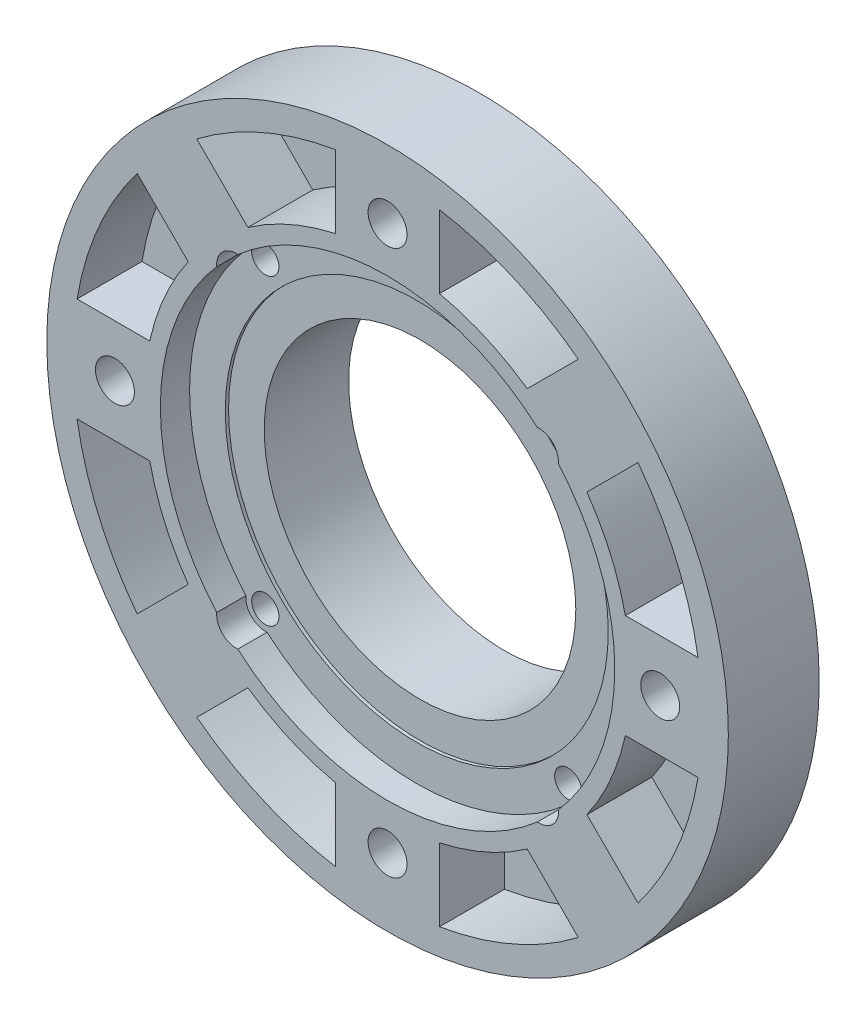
ISO-10303-21;
HEADER;
FILE_DESCRIPTION(('STEP AP214'),'2;1');
FILE_NAME('part.step','',(''),(''),'','','');
FILE_SCHEMA(('AUTOMOTIVE_DESIGN { 1 0 10303 214 1 1 1 1 }'));
ENDSEC;
DATA;
#1=APPLICATION_CONTEXT('core data for automotive mechanical design processes');
#2=APPLICATION_PROTOCOL_DEFINITION('international standard','automotive_design',2000,#1);
#3=PRODUCT_CONTEXT('',#1,'mechanical');
#4=PRODUCT('Part','Part','',(#3));
#5=PRODUCT_RELATED_PRODUCT_CATEGORY('part','',(#4));
#6=PRODUCT_DEFINITION_FORMATION('','',#4);
#7=PRODUCT_DEFINITION_CONTEXT('part definition',#1,'design');
#8=PRODUCT_DEFINITION('design','',#6,#7);
#9=PRODUCT_DEFINITION_SHAPE('','',#8);
#10=(LENGTH_UNIT() NAMED_UNIT(*) SI_UNIT(.MILLI.,.METRE.));
#11=(NAMED_UNIT(*) PLANE_ANGLE_UNIT() SI_UNIT($,.RADIAN.));
#12=(NAMED_UNIT(*) SI_UNIT($,.STERADIAN.) SOLID_ANGLE_UNIT());
#13=UNCERTAINTY_MEASURE_WITH_UNIT(LENGTH_MEASURE(1.E-05),#10,'distance_accuracy_value','');
#14=(GEOMETRIC_REPRESENTATION_CONTEXT(3) GLOBAL_UNCERTAINTY_ASSIGNED_CONTEXT((#13)) GLOBAL_UNIT_ASSIGNED_CONTEXT((#10,
#11,#12)) REPRESENTATION_CONTEXT('',''));
#15=CARTESIAN_POINT('',(0.,0.,0.));
#16=DIRECTION('',(0.,0.,1.));
#17=DIRECTION('',(1.,0.,0.));
#18=AXIS2_PLACEMENT_3D('',#15,#16,#17);
#19=CARTESIAN_POINT('',(23.3345237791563,-23.3345237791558,18.));
#20=DIRECTION('',(0.,0.,-1.));
#21=DIRECTION('',(-1.,0.,0.));
#22=AXIS2_PLACEMENT_3D('',#19,#20,#21);
#23=CYLINDRICAL_SURFACE('',#22,2.1);
#24=CARTESIAN_POINT('',(23.3345237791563,-23.3345237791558,2.));
#25=DIRECTION('',(0.,0.,-1.));
#26=DIRECTION('',(-1.,0.,0.));
#27=AXIS2_PLACEMENT_3D('',#24,#25,#26);
#28=CIRCLE('',#27,2.1);
#29=CARTESIAN_POINT('',(21.2345237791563,-23.3345237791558,2.));
#30=VERTEX_POINT('',#29);
#31=EDGE_CURVE('E908',#30,#30,#28,.T.);
#32=ORIENTED_EDGE('',*,*,#31,.T.);
#33=EDGE_LOOP('',(#32));
#34=FACE_BOUND('',#33,.T.);
#35=CARTESIAN_POINT('',(23.3345237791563,-23.3345237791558,13.5));
#36=DIRECTION('',(0.,0.,1.));
#37=DIRECTION('',(1.,0.,0.));
#38=AXIS2_PLACEMENT_3D('',#35,#36,#37);
#39=CIRCLE('',#38,2.1);
#40=CARTESIAN_POINT('',(25.4345237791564,-23.3345237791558,13.5));
#41=VERTEX_POINT('',#40);
#42=EDGE_CURVE('E34',#41,#41,#39,.T.);
#43=ORIENTED_EDGE('',*,*,#42,.T.);
#44=EDGE_LOOP('',(#43));
#45=FACE_BOUND('',#44,.T.);
#46=ADVANCED_FACE('F26',(#34,#45),#23,.F.);
#47=CARTESIAN_POINT('',(-23.3345237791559,-23.3345237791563,18.));
#48=DIRECTION('',(0.,0.,-1.));
#49=DIRECTION('',(-1.,0.,0.));
#50=AXIS2_PLACEMENT_3D('',#47,#48,#49);
#51=CYLINDRICAL_SURFACE('',#50,2.1);
#52=CARTESIAN_POINT('',(-23.3345237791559,-23.3345237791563,2.));
#53=DIRECTION('',(0.,0.,-1.));
#54=DIRECTION('',(-1.,0.,0.));
#55=AXIS2_PLACEMENT_3D('',#52,#53,#54);
#56=CIRCLE('',#55,2.1);
#57=CARTESIAN_POINT('',(-25.4345237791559,-23.3345237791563,2.));
#58=VERTEX_POINT('',#57);
#59=EDGE_CURVE('E905',#58,#58,#56,.T.);
#60=ORIENTED_EDGE('',*,*,#59,.T.);
#61=EDGE_LOOP('',(#60));
#62=FACE_BOUND('',#61,.T.);
#63=CARTESIAN_POINT('',(-23.3345237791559,-23.3345237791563,13.5));
#64=DIRECTION('',(0.,0.,1.));
#65=DIRECTION('',(1.,0.,0.));
#66=AXIS2_PLACEMENT_3D('',#63,#64,#65);
#67=CIRCLE('',#66,2.1);
#68=CARTESIAN_POINT('',(-21.2345237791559,-23.3345237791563,13.5));
#69=VERTEX_POINT('',#68);
#70=EDGE_CURVE('E463',#69,#69,#67,.T.);
#71=ORIENTED_EDGE('',*,*,#70,.T.);
#72=EDGE_LOOP('',(#71));
#73=FACE_BOUND('',#72,.T.);
#74=ADVANCED_FACE('F970',(#62,#73),#51,.F.);
#75=CARTESIAN_POINT('',(-23.3345237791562,23.3345237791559,18.));
#76=DIRECTION('',(0.,0.,-1.));
#77=DIRECTION('',(-1.,0.,0.));
#78=AXIS2_PLACEMENT_3D('',#75,#76,#77);
#79=CYLINDRICAL_SURFACE('',#78,2.1);
#80=CARTESIAN_POINT('',(-23.3345237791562,23.3345237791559,2.));
#81=DIRECTION('',(0.,0.,-1.));
#82=DIRECTION('',(-1.,0.,0.));
#83=AXIS2_PLACEMENT_3D('',#80,#81,#82);
#84=CIRCLE('',#83,2.1);
#85=CARTESIAN_POINT('',(-25.4345237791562,23.3345237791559,2.));
#86=VERTEX_POINT('',#85);
#87=EDGE_CURVE('E902',#86,#86,#84,.T.);
#88=ORIENTED_EDGE('',*,*,#87,.T.);
#89=EDGE_LOOP('',(#88));
#90=FACE_BOUND('',#89,.T.);
#91=CARTESIAN_POINT('',(-23.3345237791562,23.3345237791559,13.5));
#92=DIRECTION('',(0.,0.,1.));
#93=DIRECTION('',(1.,0.,0.));
#94=AXIS2_PLACEMENT_3D('',#91,#92,#93);
#95=CIRCLE('',#94,2.1);
#96=CARTESIAN_POINT('',(-21.2345237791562,23.3345237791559,13.5));
#97=VERTEX_POINT('',#96);
#98=EDGE_CURVE('E460',#97,#97,#95,.T.);
#99=ORIENTED_EDGE('',*,*,#98,.T.);
#100=EDGE_LOOP('',(#99));
#101=FACE_BOUND('',#100,.T.);
#102=ADVANCED_FACE('F976',(#90,#101),#79,.F.);
#103=CARTESIAN_POINT('',(23.334523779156,23.3345237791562,18.));
#104=DIRECTION('',(0.,0.,-1.));
#105=DIRECTION('',(-1.,0.,0.));
#106=AXIS2_PLACEMENT_3D('',#103,#104,#105);
#107=CYLINDRICAL_SURFACE('',#106,2.10000000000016);
#108=CARTESIAN_POINT('',(23.334523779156,23.3345237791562,2.));
#109=DIRECTION('',(0.,0.,-1.));
#110=DIRECTION('',(-1.,0.,0.));
#111=AXIS2_PLACEMENT_3D('',#108,#109,#110);
#112=CIRCLE('',#111,2.10000000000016);
#113=CARTESIAN_POINT('',(21.2345237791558,23.3345237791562,2.));
#114=VERTEX_POINT('',#113);
#115=EDGE_CURVE('E911',#114,#114,#112,.T.);
#116=ORIENTED_EDGE('',*,*,#115,.T.);
#117=EDGE_LOOP('',(#116));
#118=FACE_BOUND('',#117,.T.);
#119=CARTESIAN_POINT('',(23.334523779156,23.3345237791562,13.5));
#120=DIRECTION('',(0.,0.,1.));
#121=DIRECTION('',(1.,0.,0.));
#122=AXIS2_PLACEMENT_3D('',#119,#120,#121);
#123=CIRCLE('',#122,2.10000000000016);
#124=CARTESIAN_POINT('',(25.4345237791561,23.3345237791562,13.5));
#125=VERTEX_POINT('',#124);
#126=EDGE_CURVE('E11',#125,#125,#123,.T.);
#127=ORIENTED_EDGE('',*,*,#126,.T.);
#128=EDGE_LOOP('',(#127));
#129=FACE_BOUND('',#128,.T.);
#130=ADVANCED_FACE('F966',(#118,#129),#107,.F.);
#131=CARTESIAN_POINT('',(0.,0.,13.5));
#132=DIRECTION('',(0.,0.,1.));
#133=DIRECTION('',(1.,0.,0.));
#134=AXIS2_PLACEMENT_3D('',#131,#132,#133);
#135=CYLINDRICAL_SURFACE('',#134,35.);
#136=CARTESIAN_POINT('',(0.,0.,18.));
#137=DIRECTION('',(0.,0.,1.));
#138=DIRECTION('',(1.,0.,0.));
#139=AXIS2_PLACEMENT_3D('',#136,#137,#138);
#140=CIRCLE('',#139,35.);
#141=CARTESIAN_POINT('',(23.0677026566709,26.3226346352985,18.));
#142=VERTEX_POINT('',#141);
#143=CARTESIAN_POINT('',(-23.0677026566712,26.3226346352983,18.));
#144=VERTEX_POINT('',#143);
#145=EDGE_CURVE('E418',#142,#144,#140,.T.);
#146=ORIENTED_EDGE('',*,*,#145,.T.);
#147=DIRECTION('',(0.,0.,1.));
#148=VECTOR('',#147,1.);
#149=CARTESIAN_POINT('',(-23.0677026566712,26.3226346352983,15.75));
#150=LINE('',#149,#148);
#151=CARTESIAN_POINT('',(-23.0677026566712,26.3226346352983,13.5));
#152=VERTEX_POINT('',#151);
#153=EDGE_CURVE('E924',#144,#152,#150,.F.);
#154=ORIENTED_EDGE('',*,*,#153,.T.);
#155=CARTESIAN_POINT('',(0.,0.,13.5));
#156=DIRECTION('',(0.,0.,1.));
#157=DIRECTION('',(1.,0.,0.));
#158=AXIS2_PLACEMENT_3D('',#155,#156,#157);
#159=CIRCLE('',#158,35.);
#160=CARTESIAN_POINT('',(23.0677026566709,26.3226346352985,13.5));
#161=VERTEX_POINT('',#160);
#162=EDGE_CURVE('E407',#161,#152,#159,.T.);
#163=ORIENTED_EDGE('',*,*,#162,.F.);
#164=DIRECTION('',(0.,0.,1.));
#165=VECTOR('',#164,1.);
#166=CARTESIAN_POINT('',(23.0677026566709,26.3226346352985,15.75));
#167=LINE('',#166,#165);
#168=EDGE_CURVE('E914',#161,#142,#167,.T.);
#169=ORIENTED_EDGE('',*,*,#168,.T.);
#170=EDGE_LOOP('',(#146,#154,#163,#169));
#171=FACE_BOUND('',#170,.T.);
#172=ADVANCED_FACE('F951',(#171),#135,.F.);
#173=CARTESIAN_POINT('',(26.3226346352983,-23.0677026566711,13.5));
#174=VERTEX_POINT('',#173);
#175=CARTESIAN_POINT('',(26.3226346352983,23.0677026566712,13.5));
#176=VERTEX_POINT('',#175);
#177=EDGE_CURVE('E405',#174,#176,#159,.T.);
#178=ORIENTED_EDGE('',*,*,#177,.F.);
#179=DIRECTION('',(0.,0.,1.));
#180=VECTOR('',#179,1.);
#181=CARTESIAN_POINT('',(26.3226346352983,-23.0677026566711,15.75));
#182=LINE('',#181,#180);
#183=CARTESIAN_POINT('',(26.3226346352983,-23.0677026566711,18.));
#184=VERTEX_POINT('',#183);
#185=EDGE_CURVE('E384',#174,#184,#182,.T.);
#186=ORIENTED_EDGE('',*,*,#185,.T.);
#187=CARTESIAN_POINT('',(26.3226346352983,23.0677026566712,18.));
#188=VERTEX_POINT('',#187);
#189=EDGE_CURVE('E417',#184,#188,#140,.T.);
#190=ORIENTED_EDGE('',*,*,#189,.T.);
#191=DIRECTION('',(0.,0.,1.));
#192=VECTOR('',#191,1.);
#193=CARTESIAN_POINT('',(26.3226346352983,23.0677026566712,15.75));
#194=LINE('',#193,#192);
#195=EDGE_CURVE('E916',#188,#176,#194,.F.);
#196=ORIENTED_EDGE('',*,*,#195,.T.);
#197=EDGE_LOOP('',(#178,#186,#190,#196));
#198=FACE_BOUND('',#197,.T.);
#199=ADVANCED_FACE('F943',(#198),#135,.F.);
#200=CARTESIAN_POINT('',(-23.0677026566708,-26.3226346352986,18.));
#201=VERTEX_POINT('',#200);
#202=CARTESIAN_POINT('',(23.0677026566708,-26.3226346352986,18.));
#203=VERTEX_POINT('',#202);
#204=EDGE_CURVE('E397',#201,#203,#140,.T.);
#205=ORIENTED_EDGE('',*,*,#204,.T.);
#206=DIRECTION('',(0.,0.,1.));
#207=VECTOR('',#206,1.);
#208=CARTESIAN_POINT('',(23.0677026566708,-26.3226346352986,15.75));
#209=LINE('',#208,#207);
#210=CARTESIAN_POINT('',(23.0677026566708,-26.3226346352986,13.5));
#211=VERTEX_POINT('',#210);
#212=EDGE_CURVE('E381',#203,#211,#209,.F.);
#213=ORIENTED_EDGE('',*,*,#212,.T.);
#214=CARTESIAN_POINT('',(-23.0677026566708,-26.3226346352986,13.5));
#215=VERTEX_POINT('',#214);
#216=EDGE_CURVE('E395',#215,#211,#159,.T.);
#217=ORIENTED_EDGE('',*,*,#216,.F.);
#218=DIRECTION('',(0.,0.,1.));
#219=VECTOR('',#218,1.);
#220=CARTESIAN_POINT('',(-23.0677026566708,-26.3226346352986,15.75));
#221=LINE('',#220,#219);
#222=EDGE_CURVE('E932',#215,#201,#221,.T.);
#223=ORIENTED_EDGE('',*,*,#222,.T.);
#224=EDGE_LOOP('',(#205,#213,#217,#223));
#225=FACE_BOUND('',#224,.T.);
#226=ADVANCED_FACE('F393',(#225),#135,.F.);
#227=CARTESIAN_POINT('',(42.,2.93284602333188E-13,18.));
#228=DIRECTION('',(0.,0.,-1.));
#229=DIRECTION('',(-1.,0.,0.));
#230=AXIS2_PLACEMENT_3D('',#227,#228,#229);
#231=CYLINDRICAL_SURFACE('',#230,3.);
#232=CARTESIAN_POINT('',(42.,2.93284602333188E-13,18.));
#233=DIRECTION('',(0.,0.,-1.));
#234=DIRECTION('',(-1.,0.,0.));
#235=AXIS2_PLACEMENT_3D('',#232,#233,#234);
#236=CIRCLE('',#235,3.);
#237=CARTESIAN_POINT('',(39.,2.93284602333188E-13,18.));
#238=VERTEX_POINT('',#237);
#239=EDGE_CURVE('E496',#238,#238,#236,.T.);
#240=ORIENTED_EDGE('',*,*,#239,.F.);
#241=EDGE_LOOP('',(#240));
#242=FACE_BOUND('',#241,.T.);
#243=CARTESIAN_POINT('',(42.,2.93284602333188E-13,10.));
#244=DIRECTION('',(0.,0.,-1.));
#245=DIRECTION('',(-1.,0.,0.));
#246=AXIS2_PLACEMENT_3D('',#243,#244,#245);
#247=CIRCLE('',#246,3.);
#248=CARTESIAN_POINT('',(39.,2.93284602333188E-13,10.));
#249=VERTEX_POINT('',#248);
#250=EDGE_CURVE('E455',#249,#249,#247,.F.);
#251=ORIENTED_EDGE('',*,*,#250,.F.);
#252=EDGE_LOOP('',(#251));
#253=FACE_BOUND('',#252,.T.);
#254=ADVANCED_FACE('F968',(#242,#253),#231,.F.);
#255=CARTESIAN_POINT('',(1.46642301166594E-13,-42.,18.));
#256=DIRECTION('',(0.,0.,-1.));
#257=DIRECTION('',(-1.,0.,0.));
#258=AXIS2_PLACEMENT_3D('',#255,#256,#257);
#259=CYLINDRICAL_SURFACE('',#258,3.);
#260=CARTESIAN_POINT('',(1.46642301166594E-13,-42.,18.));
#261=DIRECTION('',(0.,0.,-1.));
#262=DIRECTION('',(-1.,0.,0.));
#263=AXIS2_PLACEMENT_3D('',#260,#261,#262);
#264=CIRCLE('',#263,3.);
#265=CARTESIAN_POINT('',(-2.99999999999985,-42.,18.));
#266=VERTEX_POINT('',#265);
#267=EDGE_CURVE('E493',#266,#266,#264,.T.);
#268=ORIENTED_EDGE('',*,*,#267,.F.);
#269=EDGE_LOOP('',(#268));
#270=FACE_BOUND('',#269,.T.);
#271=CARTESIAN_POINT('',(1.46642301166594E-13,-42.,10.));
#272=DIRECTION('',(0.,0.,-1.));
#273=DIRECTION('',(-1.,0.,0.));
#274=AXIS2_PLACEMENT_3D('',#271,#272,#273);
#275=CIRCLE('',#274,3.);
#276=CARTESIAN_POINT('',(-2.99999999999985,-42.,10.));
#277=VERTEX_POINT('',#276);
#278=EDGE_CURVE('E450',#277,#277,#275,.F.);
#279=ORIENTED_EDGE('',*,*,#278,.F.);
#280=EDGE_LOOP('',(#279));
#281=FACE_BOUND('',#280,.T.);
#282=ADVANCED_FACE('F1251',(#270,#281),#259,.F.);
#283=CARTESIAN_POINT('',(-42.,0.,18.));
#284=DIRECTION('',(0.,0.,-1.));
#285=DIRECTION('',(-1.,0.,0.));
#286=AXIS2_PLACEMENT_3D('',#283,#284,#285);
#287=CYLINDRICAL_SURFACE('',#286,3.);
#288=CARTESIAN_POINT('',(-42.,0.,18.));
#289=DIRECTION('',(0.,0.,-1.));
#290=DIRECTION('',(-1.,0.,0.));
#291=AXIS2_PLACEMENT_3D('',#288,#289,#290);
#292=CIRCLE('',#291,3.);
#293=CARTESIAN_POINT('',(-45.,0.,18.));
#294=VERTEX_POINT('',#293);
#295=EDGE_CURVE('E490',#294,#294,#292,.T.);
#296=ORIENTED_EDGE('',*,*,#295,.F.);
#297=EDGE_LOOP('',(#296));
#298=FACE_BOUND('',#297,.T.);
#299=CARTESIAN_POINT('',(-42.,0.,10.));
#300=DIRECTION('',(0.,0.,-1.));
#301=DIRECTION('',(-1.,0.,0.));
#302=AXIS2_PLACEMENT_3D('',#299,#300,#301);
#303=CIRCLE('',#302,3.);
#304=CARTESIAN_POINT('',(-45.,0.,10.));
#305=VERTEX_POINT('',#304);
#306=EDGE_CURVE('E445',#305,#305,#303,.F.);
#307=ORIENTED_EDGE('',*,*,#306,.F.);
#308=EDGE_LOOP('',(#307));
#309=FACE_BOUND('',#308,.T.);
#310=ADVANCED_FACE('F1247',(#298,#309),#287,.F.);
#311=CARTESIAN_POINT('',(-4.39926903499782E-13,42.,18.));
#312=DIRECTION('',(0.,0.,-1.));
#313=DIRECTION('',(-1.,0.,0.));
#314=AXIS2_PLACEMENT_3D('',#311,#312,#313);
#315=CYLINDRICAL_SURFACE('',#314,3.);
#316=CARTESIAN_POINT('',(-4.39926903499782E-13,42.,18.));
#317=DIRECTION('',(0.,0.,-1.));
#318=DIRECTION('',(-1.,0.,0.));
#319=AXIS2_PLACEMENT_3D('',#316,#317,#318);
#320=CIRCLE('',#319,3.);
#321=CARTESIAN_POINT('',(-3.00000000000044,42.,18.));
#322=VERTEX_POINT('',#321);
#323=EDGE_CURVE('E499',#322,#322,#320,.T.);
#324=ORIENTED_EDGE('',*,*,#323,.F.);
#325=EDGE_LOOP('',(#324));
#326=FACE_BOUND('',#325,.T.);
#327=CARTESIAN_POINT('',(-4.39926903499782E-13,42.,10.));
#328=DIRECTION('',(0.,0.,-1.));
#329=DIRECTION('',(-1.,0.,0.));
#330=AXIS2_PLACEMENT_3D('',#327,#328,#329);
#331=CIRCLE('',#330,3.);
#332=CARTESIAN_POINT('',(-3.00000000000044,42.,10.));
#333=VERTEX_POINT('',#332);
#334=EDGE_CURVE('E440',#333,#333,#331,.F.);
#335=ORIENTED_EDGE('',*,*,#334,.F.);
#336=EDGE_LOOP('',(#335));
#337=FACE_BOUND('',#336,.T.);
#338=ADVANCED_FACE('F1244',(#326,#337),#315,.F.);
#339=CARTESIAN_POINT('',(0.,0.,18.));
#340=DIRECTION('',(0.,0.,-1.));
#341=DIRECTION('',(-1.,0.,0.));
#342=AXIS2_PLACEMENT_3D('',#339,#340,#341);
#343=CYLINDRICAL_SURFACE('',#342,52.5);
#344=CARTESIAN_POINT('',(0.,0.,18.));
#345=DIRECTION('',(0.,0.,1.));
#346=DIRECTION('',(1.,0.,0.));
#347=AXIS2_PLACEMENT_3D('',#344,#345,#346);
#348=CIRCLE('',#347,52.5);
#349=CARTESIAN_POINT('',(52.5,0.,18.));
#350=VERTEX_POINT('',#349);
#351=EDGE_CURVE('E439',#350,#350,#348,.T.);
#352=ORIENTED_EDGE('',*,*,#351,.F.);
#353=EDGE_LOOP('',(#352));
#354=FACE_BOUND('',#353,.T.);
#355=CARTESIAN_POINT('',(0.,0.,4.));
#356=DIRECTION('',(0.,0.,-1.));
#357=DIRECTION('',(-1.,0.,0.));
#358=AXIS2_PLACEMENT_3D('',#355,#356,#357);
#359=CIRCLE('',#358,52.5);
#360=CARTESIAN_POINT('',(-52.5,0.,4.));
#361=VERTEX_POINT('',#360);
#362=EDGE_CURVE('E502',#361,#361,#359,.T.);
#363=ORIENTED_EDGE('',*,*,#362,.F.);
#364=EDGE_LOOP('',(#363));
#365=FACE_BOUND('',#364,.T.);
#366=ADVANCED_FACE('F28',(#354,#365),#343,.T.);
#367=CARTESIAN_POINT('',(0.,0.,2.));
#368=DIRECTION('',(0.,0.,-1.));
#369=DIRECTION('',(-1.,0.,0.));
#370=AXIS2_PLACEMENT_3D('',#367,#368,#369);
#371=PLANE('',#370);
#372=ORIENTED_EDGE('',*,*,#115,.F.);
#373=EDGE_LOOP('',(#372));
#374=FACE_BOUND('',#373,.T.);
#375=ORIENTED_EDGE('',*,*,#31,.F.);
#376=EDGE_LOOP('',(#375));
#377=FACE_BOUND('',#376,.T.);
#378=ORIENTED_EDGE('',*,*,#59,.F.);
#379=EDGE_LOOP('',(#378));
#380=FACE_BOUND('',#379,.T.);
#381=ORIENTED_EDGE('',*,*,#87,.F.);
#382=EDGE_LOOP('',(#381));
#383=FACE_BOUND('',#382,.T.);
#384=CARTESIAN_POINT('',(0.,0.,2.));
#385=DIRECTION('',(0.,0.,-1.));
#386=DIRECTION('',(-1.,0.,0.));
#387=AXIS2_PLACEMENT_3D('',#384,#385,#386);
#388=CIRCLE('',#387,26.);
#389=CARTESIAN_POINT('',(-26.,0.,2.));
#390=VERTEX_POINT('',#389);
#391=EDGE_CURVE('E482',#390,#390,#388,.T.);
#392=ORIENTED_EDGE('',*,*,#391,.F.);
#393=EDGE_LOOP('',(#392));
#394=FACE_BOUND('',#393,.T.);
#395=CARTESIAN_POINT('',(-42.,0.,2.));
#396=DIRECTION('',(0.,0.,1.));
#397=DIRECTION('',(-1.,0.,0.));
#398=AXIS2_PLACEMENT_3D('',#395,#396,#397);
#399=CIRCLE('',#398,9.00000000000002);
#400=CARTESIAN_POINT('',(-37.1875,-7.60525106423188,2.));
#401=VERTEX_POINT('',#400);
#402=CARTESIAN_POINT('',(-37.1875,7.60525106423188,2.));
#403=VERTEX_POINT('',#402);
#404=EDGE_CURVE('E586',#401,#403,#399,.T.);
#405=ORIENTED_EDGE('',*,*,#404,.T.);
#406=CARTESIAN_POINT('',(-35.5833333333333,10.1403347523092,2.));
#407=DIRECTION('',(0.,0.,-1.));
#408=DIRECTION('',(1.,0.,0.));
#409=AXIS2_PLACEMENT_3D('',#406,#407,#408);
#410=CIRCLE('',#409,3.);
#411=CARTESIAN_POINT('',(-38.4684684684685,10.9625240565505,2.));
#412=VERTEX_POINT('',#411);
#413=EDGE_CURVE('E443',#403,#412,#410,.T.);
#414=ORIENTED_EDGE('',*,*,#413,.T.);
#415=CARTESIAN_POINT('',(0.,0.,2.));
#416=DIRECTION('',(0.,0.,-1.));
#417=DIRECTION('',(-1.,0.,0.));
#418=AXIS2_PLACEMENT_3D('',#415,#416,#417);
#419=CIRCLE('',#418,40.);
#420=CARTESIAN_POINT('',(-10.9625240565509,38.4684684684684,2.));
#421=VERTEX_POINT('',#420);
#422=EDGE_CURVE('E628',#412,#421,#419,.T.);
#423=ORIENTED_EDGE('',*,*,#422,.T.);
#424=CARTESIAN_POINT('',(-10.1403347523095,35.5833333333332,2.));
#425=DIRECTION('',(0.,0.,-1.));
#426=DIRECTION('',(-1.,0.,0.));
#427=AXIS2_PLACEMENT_3D('',#424,#425,#426);
#428=CIRCLE('',#427,3.);
#429=CARTESIAN_POINT('',(-7.60525106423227,37.1874999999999,2.));
#430=VERTEX_POINT('',#429);
#431=EDGE_CURVE('E625',#421,#430,#428,.T.);
#432=ORIENTED_EDGE('',*,*,#431,.T.);
#433=CARTESIAN_POINT('',(-4.39926903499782E-13,42.,2.));
#434=DIRECTION('',(0.,0.,1.));
#435=DIRECTION('',(-1.,0.,0.));
#436=AXIS2_PLACEMENT_3D('',#433,#434,#435);
#437=CIRCLE('',#436,9.00000000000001);
#438=CARTESIAN_POINT('',(7.60525106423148,37.1875000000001,2.));
#439=VERTEX_POINT('',#438);
#440=EDGE_CURVE('E622',#430,#439,#437,.T.);
#441=ORIENTED_EDGE('',*,*,#440,.T.);
#442=CARTESIAN_POINT('',(10.1403347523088,35.5833333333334,2.));
#443=DIRECTION('',(0.,0.,-1.));
#444=DIRECTION('',(-1.,0.,0.));
#445=AXIS2_PLACEMENT_3D('',#442,#443,#444);
#446=CIRCLE('',#445,3.);
#447=CARTESIAN_POINT('',(10.96252405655,38.4684684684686,2.));
#448=VERTEX_POINT('',#447);
#449=EDGE_CURVE('E619',#439,#448,#446,.T.);
#450=ORIENTED_EDGE('',*,*,#449,.T.);
#451=CARTESIAN_POINT('',(0.,0.,2.));
#452=DIRECTION('',(0.,0.,-1.));
#453=DIRECTION('',(-1.,0.,0.));
#454=AXIS2_PLACEMENT_3D('',#451,#452,#453);
#455=CIRCLE('',#454,40.);
#456=CARTESIAN_POINT('',(38.4684684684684,10.9625240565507,2.));
#457=VERTEX_POINT('',#456);
#458=EDGE_CURVE('E616',#448,#457,#455,.T.);
#459=ORIENTED_EDGE('',*,*,#458,.T.);
#460=CARTESIAN_POINT('',(35.5833333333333,10.1403347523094,2.));
#461=DIRECTION('',(0.,0.,-1.));
#462=DIRECTION('',(-1.,0.,0.));
#463=AXIS2_PLACEMENT_3D('',#460,#461,#462);
#464=CIRCLE('',#463,3.);
#465=CARTESIAN_POINT('',(37.1874999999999,7.60525106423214,2.));
#466=VERTEX_POINT('',#465);
#467=EDGE_CURVE('E613',#457,#466,#464,.T.);
#468=ORIENTED_EDGE('',*,*,#467,.T.);
#469=CARTESIAN_POINT('',(42.,2.93284602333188E-13,2.));
#470=DIRECTION('',(0.,0.,1.));
#471=DIRECTION('',(-1.,0.,0.));
#472=AXIS2_PLACEMENT_3D('',#469,#470,#471);
#473=CIRCLE('',#472,9.00000000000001);
#474=CARTESIAN_POINT('',(37.1875000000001,-7.60525106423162,2.));
#475=VERTEX_POINT('',#474);
#476=EDGE_CURVE('E610',#466,#475,#473,.T.);
#477=ORIENTED_EDGE('',*,*,#476,.T.);
#478=CARTESIAN_POINT('',(35.5833333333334,-10.1403347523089,2.));
#479=DIRECTION('',(0.,0.,-1.));
#480=DIRECTION('',(-1.,0.,0.));
#481=AXIS2_PLACEMENT_3D('',#478,#479,#480);
#482=CIRCLE('',#481,3.);
#483=CARTESIAN_POINT('',(38.4684684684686,-10.9625240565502,2.));
#484=VERTEX_POINT('',#483);
#485=EDGE_CURVE('E607',#475,#484,#482,.T.);
#486=ORIENTED_EDGE('',*,*,#485,.T.);
#487=CARTESIAN_POINT('',(0.,0.,2.));
#488=DIRECTION('',(0.,0.,-1.));
#489=DIRECTION('',(-1.,0.,0.));
#490=AXIS2_PLACEMENT_3D('',#487,#488,#489);
#491=CIRCLE('',#490,40.);
#492=CARTESIAN_POINT('',(10.9625240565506,-38.4684684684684,2.));
#493=VERTEX_POINT('',#492);
#494=EDGE_CURVE('E604',#484,#493,#491,.T.);
#495=ORIENTED_EDGE('',*,*,#494,.T.);
#496=CARTESIAN_POINT('',(10.1403347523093,-35.5833333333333,2.));
#497=DIRECTION('',(0.,0.,-1.));
#498=DIRECTION('',(-1.,0.,0.));
#499=AXIS2_PLACEMENT_3D('',#496,#497,#498);
#500=CIRCLE('',#499,3.);
#501=CARTESIAN_POINT('',(7.60525106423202,-37.1875,2.));
#502=VERTEX_POINT('',#501);
#503=EDGE_CURVE('E601',#493,#502,#500,.T.);
#504=ORIENTED_EDGE('',*,*,#503,.T.);
#505=CARTESIAN_POINT('',(1.46642301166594E-13,-42.,2.));
#506=DIRECTION('',(0.,0.,1.));
#507=DIRECTION('',(-1.,0.,0.));
#508=AXIS2_PLACEMENT_3D('',#505,#506,#507);
#509=CIRCLE('',#508,9.00000000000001);
#510=CARTESIAN_POINT('',(-7.60525106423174,-37.1875,2.));
#511=VERTEX_POINT('',#510);
#512=EDGE_CURVE('E598',#502,#511,#509,.T.);
#513=ORIENTED_EDGE('',*,*,#512,.T.);
#514=CARTESIAN_POINT('',(-10.140334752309,-35.5833333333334,2.));
#515=DIRECTION('',(0.,0.,-1.));
#516=DIRECTION('',(-1.,0.,0.));
#517=AXIS2_PLACEMENT_3D('',#514,#515,#516);
#518=CIRCLE('',#517,3.);
#519=CARTESIAN_POINT('',(-10.9625240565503,-38.4684684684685,2.));
#520=VERTEX_POINT('',#519);
#521=EDGE_CURVE('E595',#511,#520,#518,.T.);
#522=ORIENTED_EDGE('',*,*,#521,.T.);
#523=CARTESIAN_POINT('',(0.,0.,2.));
#524=DIRECTION('',(0.,0.,-1.));
#525=DIRECTION('',(-1.,0.,0.));
#526=AXIS2_PLACEMENT_3D('',#523,#524,#525);
#527=CIRCLE('',#526,40.);
#528=CARTESIAN_POINT('',(-38.4684684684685,-10.9625240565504,2.));
#529=VERTEX_POINT('',#528);
#530=EDGE_CURVE('E592',#520,#529,#527,.T.);
#531=ORIENTED_EDGE('',*,*,#530,.T.);
#532=CARTESIAN_POINT('',(-35.5833333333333,-10.1403347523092,2.));
#533=DIRECTION('',(0.,0.,-1.));
#534=DIRECTION('',(-1.,0.,0.));
#535=AXIS2_PLACEMENT_3D('',#532,#533,#534);
#536=CIRCLE('',#535,3.);
#537=EDGE_CURVE('E589',#529,#401,#536,.T.);
#538=ORIENTED_EDGE('',*,*,#537,.T.);
#539=EDGE_LOOP('',(#405,#414,#423,#432,#441,#450,#459,#468,#477,#486,#495,#504,#513,#522,#531,#538));
#540=FACE_BOUND('',#539,.T.);
#541=ADVANCED_FACE('F1263',(#374,#377,#380,#383,#394,#540),#371,.T.);
#542=CARTESIAN_POINT('',(0.,0.,0.));
#543=DIRECTION('',(0.,0.,1.));
#544=DIRECTION('',(1.,0.,0.));
#545=AXIS2_PLACEMENT_3D('',#542,#543,#544);
#546=PLANE('',#545);
#547=CARTESIAN_POINT('',(0.,0.,0.));
#548=DIRECTION('',(0.,0.,1.));
#549=DIRECTION('',(1.,0.,0.));
#550=AXIS2_PLACEMENT_3D('',#547,#548,#549);
#551=CIRCLE('',#550,24.);
#552=CARTESIAN_POINT('',(24.,0.,0.));
#553=VERTEX_POINT('',#552);
#554=EDGE_CURVE('E408',#553,#553,#551,.T.);
#555=ORIENTED_EDGE('',*,*,#554,.T.);
#556=EDGE_LOOP('',(#555));
#557=FACE_BOUND('',#556,.T.);
#558=CARTESIAN_POINT('',(0.,0.,0.));
#559=DIRECTION('',(0.,0.,-1.));
#560=DIRECTION('',(-1.,0.,0.));
#561=AXIS2_PLACEMENT_3D('',#558,#559,#560);
#562=CIRCLE('',#561,26.);
#563=CARTESIAN_POINT('',(-26.,0.,0.));
#564=VERTEX_POINT('',#563);
#565=EDGE_CURVE('E485',#564,#564,#562,.T.);
#566=ORIENTED_EDGE('',*,*,#565,.T.);
#567=EDGE_LOOP('',(#566));
#568=FACE_BOUND('',#567,.T.);
#569=ADVANCED_FACE('F1266',(#557,#568),#546,.F.);
#570=CARTESIAN_POINT('',(0.,0.,18.));
#571=DIRECTION('',(0.,0.,-1.));
#572=DIRECTION('',(-1.,0.,0.));
#573=AXIS2_PLACEMENT_3D('',#570,#571,#572);
#574=CYLINDRICAL_SURFACE('',#573,24.);
#575=ORIENTED_EDGE('',*,*,#554,.F.);
#576=EDGE_LOOP('',(#575));
#577=FACE_BOUND('',#576,.T.);
#578=CARTESIAN_POINT('',(0.,0.,13.));
#579=DIRECTION('',(0.,0.,1.));
#580=DIRECTION('',(1.,0.,0.));
#581=AXIS2_PLACEMENT_3D('',#578,#579,#580);
#582=CIRCLE('',#581,24.);
#583=CARTESIAN_POINT('',(24.,0.,13.));
#584=VERTEX_POINT('',#583);
#585=EDGE_CURVE('E425',#584,#584,#582,.T.);
#586=ORIENTED_EDGE('',*,*,#585,.T.);
#587=EDGE_LOOP('',(#586));
#588=FACE_BOUND('',#587,.T.);
#589=ADVANCED_FACE('F963',(#577,#588),#574,.F.);
#590=CARTESIAN_POINT('',(0.,0.,18.));
#591=DIRECTION('',(0.,0.,1.));
#592=DIRECTION('',(1.,0.,0.));
#593=AXIS2_PLACEMENT_3D('',#590,#591,#592);
#594=PLANE('',#593);
#595=CARTESIAN_POINT('',(23.334523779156,-23.3345237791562,18.));
#596=DIRECTION('',(0.,0.,1.));
#597=DIRECTION('',(1.,0.,0.));
#598=AXIS2_PLACEMENT_3D('',#595,#596,#597);
#599=CIRCLE('',#598,3.);
#600=EDGE_CURVE('E388',#203,#184,#599,.T.);
#601=ORIENTED_EDGE('',*,*,#600,.F.);
#602=ORIENTED_EDGE('',*,*,#204,.F.);
#603=CARTESIAN_POINT('',(-23.3345237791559,-23.3345237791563,18.));
#604=DIRECTION('',(0.,0.,1.));
#605=DIRECTION('',(1.,0.,0.));
#606=AXIS2_PLACEMENT_3D('',#603,#604,#605);
#607=CIRCLE('',#606,3.);
#608=CARTESIAN_POINT('',(-26.3226346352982,-23.0677026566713,18.));
#609=VERTEX_POINT('',#608);
#610=EDGE_CURVE('E937',#609,#201,#607,.T.);
#611=ORIENTED_EDGE('',*,*,#610,.F.);
#612=CARTESIAN_POINT('',(-26.3226346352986,23.0677026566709,18.));
#613=VERTEX_POINT('',#612);
#614=EDGE_CURVE('E412',#613,#609,#140,.T.);
#615=ORIENTED_EDGE('',*,*,#614,.F.);
#616=CARTESIAN_POINT('',(-23.3345237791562,23.334523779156,18.));
#617=DIRECTION('',(0.,0.,1.));
#618=DIRECTION('',(1.,0.,0.));
#619=AXIS2_PLACEMENT_3D('',#616,#617,#618);
#620=CIRCLE('',#619,3.);
#621=EDGE_CURVE('E930',#144,#613,#620,.T.);
#622=ORIENTED_EDGE('',*,*,#621,.F.);
#623=ORIENTED_EDGE('',*,*,#145,.F.);
#624=CARTESIAN_POINT('',(23.334523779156,23.3345237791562,18.));
#625=DIRECTION('',(0.,0.,1.));
#626=DIRECTION('',(1.,0.,0.));
#627=AXIS2_PLACEMENT_3D('',#624,#625,#626);
#628=CIRCLE('',#627,3.);
#629=EDGE_CURVE('E922',#188,#142,#628,.T.);
#630=ORIENTED_EDGE('',*,*,#629,.F.);
#631=ORIENTED_EDGE('',*,*,#189,.F.);
#632=EDGE_LOOP('',(#601,#602,#611,#615,#622,#623,#630,#631));
#633=FACE_BOUND('',#632,.T.);
#634=CARTESIAN_POINT('',(0.,0.,18.));
#635=DIRECTION('',(0.,0.,-1.));
#636=DIRECTION('',(1.,0.,0.));
#637=AXIS2_PLACEMENT_3D('',#634,#635,#636);
#638=CIRCLE('',#637,37.5);
#639=CARTESIAN_POINT('',(30.7113237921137,21.5189356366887,18.));
#640=VERTEX_POINT('',#639);
#641=CARTESIAN_POINT('',(36.6367302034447,8.,18.));
#642=VERTEX_POINT('',#641);
#643=EDGE_CURVE('E41',#640,#642,#638,.T.);
#644=ORIENTED_EDGE('',*,*,#643,.F.);
#645=DIRECTION('',(-0.707106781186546,-0.707106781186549,0.));
#646=VECTOR('',#645,1.);
#647=CARTESIAN_POINT('',(30.7113237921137,21.5189356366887,18.));
#648=LINE('',#647,#646);
#649=CARTESIAN_POINT('',(38.5814850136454,29.3890968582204,18.));
#650=VERTEX_POINT('',#649);
#651=EDGE_CURVE('E892',#650,#640,#648,.T.);
#652=ORIENTED_EDGE('',*,*,#651,.F.);
#653=CARTESIAN_POINT('',(0.,0.,18.));
#654=DIRECTION('',(0.,0.,1.));
#655=DIRECTION('',(1.,0.,0.));
#656=AXIS2_PLACEMENT_3D('',#653,#654,#655);
#657=CIRCLE('',#656,48.5);
#658=CARTESIAN_POINT('',(47.8356561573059,8.,18.));
#659=VERTEX_POINT('',#658);
#660=EDGE_CURVE('E895',#659,#650,#657,.T.);
#661=ORIENTED_EDGE('',*,*,#660,.F.);
#662=DIRECTION('',(1.,0.,0.));
#663=VECTOR('',#662,1.);
#664=CARTESIAN_POINT('',(36.6367302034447,8.,18.));
#665=LINE('',#664,#663);
#666=EDGE_CURVE('E898',#642,#659,#665,.T.);
#667=ORIENTED_EDGE('',*,*,#666,.F.);
#668=EDGE_LOOP('',(#644,#652,#661,#667));
#669=FACE_BOUND('',#668,.T.);
#670=CARTESIAN_POINT('',(0.,0.,18.));
#671=DIRECTION('',(0.,0.,-1.));
#672=DIRECTION('',(1.,0.,0.));
#673=AXIS2_PLACEMENT_3D('',#670,#671,#672);
#674=CIRCLE('',#673,37.5);
#675=CARTESIAN_POINT('',(36.6367302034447,-8.,18.));
#676=VERTEX_POINT('',#675);
#677=CARTESIAN_POINT('',(30.7113237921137,-21.5189356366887,18.));
#678=VERTEX_POINT('',#677);
#679=EDGE_CURVE('E49',#676,#678,#674,.T.);
#680=ORIENTED_EDGE('',*,*,#679,.F.);
#681=DIRECTION('',(-1.,0.,0.));
#682=VECTOR('',#681,1.);
#683=CARTESIAN_POINT('',(36.6367302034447,-8.,18.));
#684=LINE('',#683,#682);
#685=CARTESIAN_POINT('',(47.8356561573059,-8.,18.));
#686=VERTEX_POINT('',#685);
#687=EDGE_CURVE('E862',#686,#676,#684,.T.);
#688=ORIENTED_EDGE('',*,*,#687,.F.);
#689=CARTESIAN_POINT('',(0.,0.,18.));
#690=DIRECTION('',(0.,0.,1.));
#691=DIRECTION('',(1.,0.,0.));
#692=AXIS2_PLACEMENT_3D('',#689,#690,#691);
#693=CIRCLE('',#692,48.5);
#694=CARTESIAN_POINT('',(38.5814850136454,-29.3890968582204,18.));
#695=VERTEX_POINT('',#694);
#696=EDGE_CURVE('E865',#695,#686,#693,.T.);
#697=ORIENTED_EDGE('',*,*,#696,.F.);
#698=DIRECTION('',(0.707106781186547,-0.707106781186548,0.));
#699=VECTOR('',#698,1.);
#700=CARTESIAN_POINT('',(30.7113237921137,-21.5189356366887,18.));
#701=LINE('',#700,#699);
#702=EDGE_CURVE('E868',#678,#695,#701,.T.);
#703=ORIENTED_EDGE('',*,*,#702,.F.);
#704=EDGE_LOOP('',(#680,#688,#697,#703));
#705=FACE_BOUND('',#704,.T.);
#706=CARTESIAN_POINT('',(0.,0.,18.));
#707=DIRECTION('',(0.,0.,-1.));
#708=DIRECTION('',(1.,0.,0.));
#709=AXIS2_PLACEMENT_3D('',#706,#707,#708);
#710=CIRCLE('',#709,37.5);
#711=CARTESIAN_POINT('',(-36.6367302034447,8.,18.));
#712=VERTEX_POINT('',#711);
#713=CARTESIAN_POINT('',(-30.7113237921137,21.5189356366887,18.));
#714=VERTEX_POINT('',#713);
#715=EDGE_CURVE('E840',#712,#714,#710,.T.);
#716=ORIENTED_EDGE('',*,*,#715,.F.);
#717=DIRECTION('',(1.,0.,0.));
#718=VECTOR('',#717,1.);
#719=CARTESIAN_POINT('',(-47.8356561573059,8.,18.));
#720=LINE('',#719,#718);
#721=CARTESIAN_POINT('',(-47.8356561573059,8.,18.));
#722=VERTEX_POINT('',#721);
#723=EDGE_CURVE('E831',#722,#712,#720,.T.);
#724=ORIENTED_EDGE('',*,*,#723,.F.);
#725=CARTESIAN_POINT('',(0.,0.,18.));
#726=DIRECTION('',(0.,0.,1.));
#727=DIRECTION('',(1.,0.,0.));
#728=AXIS2_PLACEMENT_3D('',#725,#726,#727);
#729=CIRCLE('',#728,48.5);
#730=CARTESIAN_POINT('',(-38.5814850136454,29.3890968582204,18.));
#731=VERTEX_POINT('',#730);
#732=EDGE_CURVE('E834',#731,#722,#729,.T.);
#733=ORIENTED_EDGE('',*,*,#732,.F.);
#734=DIRECTION('',(-0.707106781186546,0.707106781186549,0.));
#735=VECTOR('',#734,1.);
#736=CARTESIAN_POINT('',(-38.5814850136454,29.3890968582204,18.));
#737=LINE('',#736,#735);
#738=EDGE_CURVE('E837',#714,#731,#737,.T.);
#739=ORIENTED_EDGE('',*,*,#738,.F.);
#740=EDGE_LOOP('',(#716,#724,#733,#739));
#741=FACE_BOUND('',#740,.T.);
#742=CARTESIAN_POINT('',(0.,0.,18.));
#743=DIRECTION('',(0.,0.,1.));
#744=DIRECTION('',(1.,0.,0.));
#745=AXIS2_PLACEMENT_3D('',#742,#743,#744);
#746=CIRCLE('',#745,48.5);
#747=CARTESIAN_POINT('',(-47.8356561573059,-8.,18.));
#748=VERTEX_POINT('',#747);
#749=CARTESIAN_POINT('',(-38.5814850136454,-29.3890968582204,18.));
#750=VERTEX_POINT('',#749);
#751=EDGE_CURVE('E808',#748,#750,#746,.T.);
#752=ORIENTED_EDGE('',*,*,#751,.F.);
#753=DIRECTION('',(-1.,0.,0.));
#754=VECTOR('',#753,1.);
#755=CARTESIAN_POINT('',(-47.8356561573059,-8.,18.));
#756=LINE('',#755,#754);
#757=CARTESIAN_POINT('',(-36.6367302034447,-8.,18.));
#758=VERTEX_POINT('',#757);
#759=EDGE_CURVE('E799',#758,#748,#756,.T.);
#760=ORIENTED_EDGE('',*,*,#759,.F.);
#761=CARTESIAN_POINT('',(0.,0.,18.));
#762=DIRECTION('',(0.,0.,-1.));
#763=DIRECTION('',(1.,0.,0.));
#764=AXIS2_PLACEMENT_3D('',#761,#762,#763);
#765=CIRCLE('',#764,37.5);
#766=CARTESIAN_POINT('',(-30.7113237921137,-21.5189356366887,18.));
#767=VERTEX_POINT('',#766);
#768=EDGE_CURVE('E802',#767,#758,#765,.T.);
#769=ORIENTED_EDGE('',*,*,#768,.F.);
#770=DIRECTION('',(0.707106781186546,0.707106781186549,0.));
#771=VECTOR('',#770,1.);
#772=CARTESIAN_POINT('',(-38.5814850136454,-29.3890968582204,18.));
#773=LINE('',#772,#771);
#774=EDGE_CURVE('E805',#750,#767,#773,.T.);
#775=ORIENTED_EDGE('',*,*,#774,.F.);
#776=EDGE_LOOP('',(#752,#760,#769,#775));
#777=FACE_BOUND('',#776,.T.);
#778=CARTESIAN_POINT('',(0.,0.,18.));
#779=DIRECTION('',(0.,0.,1.));
#780=DIRECTION('',(1.,0.,0.));
#781=AXIS2_PLACEMENT_3D('',#778,#779,#780);
#782=CIRCLE('',#781,48.5);
#783=CARTESIAN_POINT('',(-8.00000000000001,47.8356561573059,18.));
#784=VERTEX_POINT('',#783);
#785=CARTESIAN_POINT('',(-29.3890968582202,38.5814850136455,18.));
#786=VERTEX_POINT('',#785);
#787=EDGE_CURVE('E776',#784,#786,#782,.T.);
#788=ORIENTED_EDGE('',*,*,#787,.F.);
#789=DIRECTION('',(0.,1.,0.));
#790=VECTOR('',#789,1.);
#791=CARTESIAN_POINT('',(-8.00000000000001,47.8356561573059,18.));
#792=LINE('',#791,#790);
#793=CARTESIAN_POINT('',(-8.,36.6367302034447,18.));
#794=VERTEX_POINT('',#793);
#795=EDGE_CURVE('E767',#794,#784,#792,.T.);
#796=ORIENTED_EDGE('',*,*,#795,.F.);
#797=CARTESIAN_POINT('',(0.,0.,18.));
#798=DIRECTION('',(0.,0.,-1.));
#799=DIRECTION('',(1.,0.,0.));
#800=AXIS2_PLACEMENT_3D('',#797,#798,#799);
#801=CIRCLE('',#800,37.5);
#802=CARTESIAN_POINT('',(-21.5189356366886,30.7113237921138,18.));
#803=VERTEX_POINT('',#802);
#804=EDGE_CURVE('E770',#803,#794,#801,.T.);
#805=ORIENTED_EDGE('',*,*,#804,.F.);
#806=DIRECTION('',(0.707106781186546,-0.707106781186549,0.));
#807=VECTOR('',#806,1.);
#808=CARTESIAN_POINT('',(-29.3890968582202,38.5814850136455,18.));
#809=LINE('',#808,#807);
#810=EDGE_CURVE('E773',#786,#803,#809,.T.);
#811=ORIENTED_EDGE('',*,*,#810,.F.);
#812=EDGE_LOOP('',(#788,#796,#805,#811));
#813=FACE_BOUND('',#812,.T.);
#814=CARTESIAN_POINT('',(0.,0.,18.));
#815=DIRECTION('',(0.,0.,1.));
#816=DIRECTION('',(1.,0.,0.));
#817=AXIS2_PLACEMENT_3D('',#814,#815,#816);
#818=CIRCLE('',#817,48.5);
#819=CARTESIAN_POINT('',(8.00000000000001,-47.8356561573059,18.));
#820=VERTEX_POINT('',#819);
#821=CARTESIAN_POINT('',(29.3890968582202,-38.5814850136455,18.));
#822=VERTEX_POINT('',#821);
#823=EDGE_CURVE('E744',#820,#822,#818,.T.);
#824=ORIENTED_EDGE('',*,*,#823,.F.);
#825=DIRECTION('',(0.,-1.,0.));
#826=VECTOR('',#825,1.);
#827=CARTESIAN_POINT('',(8.,-36.6367302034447,18.));
#828=LINE('',#827,#826);
#829=CARTESIAN_POINT('',(8.,-36.6367302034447,18.));
#830=VERTEX_POINT('',#829);
#831=EDGE_CURVE('E735',#830,#820,#828,.T.);
#832=ORIENTED_EDGE('',*,*,#831,.F.);
#833=CARTESIAN_POINT('',(0.,0.,18.));
#834=DIRECTION('',(0.,0.,-1.));
#835=DIRECTION('',(1.,0.,0.));
#836=AXIS2_PLACEMENT_3D('',#833,#834,#835);
#837=CIRCLE('',#836,37.5);
#838=CARTESIAN_POINT('',(21.5189356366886,-30.7113237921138,18.));
#839=VERTEX_POINT('',#838);
#840=EDGE_CURVE('E738',#839,#830,#837,.T.);
#841=ORIENTED_EDGE('',*,*,#840,.F.);
#842=DIRECTION('',(-0.707106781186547,0.707106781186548,0.));
#843=VECTOR('',#842,1.);
#844=CARTESIAN_POINT('',(21.5189356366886,-30.7113237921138,18.));
#845=LINE('',#844,#843);
#846=EDGE_CURVE('E741',#822,#839,#845,.T.);
#847=ORIENTED_EDGE('',*,*,#846,.F.);
#848=EDGE_LOOP('',(#824,#832,#841,#847));
#849=FACE_BOUND('',#848,.T.);
#850=CARTESIAN_POINT('',(0.,0.,18.));
#851=DIRECTION('',(0.,0.,1.));
#852=DIRECTION('',(1.,0.,0.));
#853=AXIS2_PLACEMENT_3D('',#850,#851,#852);
#854=CIRCLE('',#853,48.5);
#855=CARTESIAN_POINT('',(29.3890968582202,38.5814850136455,18.));
#856=VERTEX_POINT('',#855);
#857=CARTESIAN_POINT('',(7.99999999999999,47.8356561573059,18.));
#858=VERTEX_POINT('',#857);
#859=EDGE_CURVE('E712',#856,#858,#854,.T.);
#860=ORIENTED_EDGE('',*,*,#859,.F.);
#861=DIRECTION('',(0.707106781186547,0.707106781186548,0.));
#862=VECTOR('',#861,1.);
#863=CARTESIAN_POINT('',(21.5189356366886,30.7113237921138,18.));
#864=LINE('',#863,#862);
#865=CARTESIAN_POINT('',(21.5189356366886,30.7113237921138,18.));
#866=VERTEX_POINT('',#865);
#867=EDGE_CURVE('E703',#866,#856,#864,.T.);
#868=ORIENTED_EDGE('',*,*,#867,.F.);
#869=CARTESIAN_POINT('',(0.,0.,18.));
#870=DIRECTION('',(0.,0.,-1.));
#871=DIRECTION('',(1.,0.,0.));
#872=AXIS2_PLACEMENT_3D('',#869,#870,#871);
#873=CIRCLE('',#872,37.5);
#874=CARTESIAN_POINT('',(8.,36.6367302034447,18.));
#875=VERTEX_POINT('',#874);
#876=EDGE_CURVE('E706',#875,#866,#873,.T.);
#877=ORIENTED_EDGE('',*,*,#876,.F.);
#878=DIRECTION('',(0.,-1.,0.));
#879=VECTOR('',#878,1.);
#880=CARTESIAN_POINT('',(7.99999999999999,47.8356561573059,18.));
#881=LINE('',#880,#879);
#882=EDGE_CURVE('E709',#858,#875,#881,.T.);
#883=ORIENTED_EDGE('',*,*,#882,.F.);
#884=EDGE_LOOP('',(#860,#868,#877,#883));
#885=FACE_BOUND('',#884,.T.);
#886=CARTESIAN_POINT('',(0.,0.,18.));
#887=DIRECTION('',(0.,0.,-1.));
#888=DIRECTION('',(1.,0.,0.));
#889=AXIS2_PLACEMENT_3D('',#886,#887,#888);
#890=CIRCLE('',#889,37.5);
#891=CARTESIAN_POINT('',(-8.,-36.6367302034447,18.));
#892=VERTEX_POINT('',#891);
#893=CARTESIAN_POINT('',(-21.5189356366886,-30.7113237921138,18.));
#894=VERTEX_POINT('',#893);
#895=EDGE_CURVE('E680',#892,#894,#890,.T.);
#896=ORIENTED_EDGE('',*,*,#895,.F.);
#897=DIRECTION('',(0.,1.,0.));
#898=VECTOR('',#897,1.);
#899=CARTESIAN_POINT('',(-8.,-36.6367302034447,18.));
#900=LINE('',#899,#898);
#901=CARTESIAN_POINT('',(-7.99999999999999,-47.8356561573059,18.));
#902=VERTEX_POINT('',#901);
#903=EDGE_CURVE('E671',#902,#892,#900,.T.);
#904=ORIENTED_EDGE('',*,*,#903,.F.);
#905=CARTESIAN_POINT('',(0.,0.,18.));
#906=DIRECTION('',(0.,0.,1.));
#907=DIRECTION('',(1.,0.,0.));
#908=AXIS2_PLACEMENT_3D('',#905,#906,#907);
#909=CIRCLE('',#908,48.5);
#910=CARTESIAN_POINT('',(-29.3890968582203,-38.5814850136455,18.));
#911=VERTEX_POINT('',#910);
#912=EDGE_CURVE('E674',#911,#902,#909,.T.);
#913=ORIENTED_EDGE('',*,*,#912,.F.);
#914=DIRECTION('',(-0.707106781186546,-0.707106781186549,0.));
#915=VECTOR('',#914,1.);
#916=CARTESIAN_POINT('',(-29.3890968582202,-38.5814850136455,18.));
#917=LINE('',#916,#915);
#918=EDGE_CURVE('E677',#894,#911,#917,.T.);
#919=ORIENTED_EDGE('',*,*,#918,.F.);
#920=EDGE_LOOP('',(#896,#904,#913,#919));
#921=FACE_BOUND('',#920,.T.);
#922=ORIENTED_EDGE('',*,*,#323,.T.);
#923=EDGE_LOOP('',(#922));
#924=FACE_BOUND('',#923,.T.);
#925=ORIENTED_EDGE('',*,*,#239,.T.);
#926=EDGE_LOOP('',(#925));
#927=FACE_BOUND('',#926,.T.);
#928=ORIENTED_EDGE('',*,*,#267,.T.);
#929=EDGE_LOOP('',(#928));
#930=FACE_BOUND('',#929,.T.);
#931=ORIENTED_EDGE('',*,*,#295,.T.);
#932=EDGE_LOOP('',(#931));
#933=FACE_BOUND('',#932,.T.);
#934=ORIENTED_EDGE('',*,*,#351,.T.);
#935=EDGE_LOOP('',(#934));
#936=FACE_BOUND('',#935,.T.);
#937=ADVANCED_FACE('F946',(#633,#669,#705,#741,#777,#813,#849,#885,#921,#924,#927,#930,#933,
#936),#594,.T.);
#938=ORIENTED_EDGE('',*,*,#614,.T.);
#939=DIRECTION('',(0.,0.,1.));
#940=VECTOR('',#939,1.);
#941=CARTESIAN_POINT('',(-26.3226346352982,-23.0677026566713,15.75));
#942=LINE('',#941,#940);
#943=CARTESIAN_POINT('',(-26.3226346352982,-23.0677026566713,13.5));
#944=VERTEX_POINT('',#943);
#945=EDGE_CURVE('E934',#609,#944,#942,.F.);
#946=ORIENTED_EDGE('',*,*,#945,.T.);
#947=CARTESIAN_POINT('',(-26.3226346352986,23.0677026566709,13.5));
#948=VERTEX_POINT('',#947);
#949=EDGE_CURVE('E404',#948,#944,#159,.T.);
#950=ORIENTED_EDGE('',*,*,#949,.F.);
#951=DIRECTION('',(0.,0.,1.));
#952=VECTOR('',#951,1.);
#953=CARTESIAN_POINT('',(-26.3226346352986,23.0677026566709,15.75));
#954=LINE('',#953,#952);
#955=EDGE_CURVE('E926',#948,#613,#954,.T.);
#956=ORIENTED_EDGE('',*,*,#955,.T.);
#957=EDGE_LOOP('',(#938,#946,#950,#956));
#958=FACE_BOUND('',#957,.T.);
#959=ADVANCED_FACE('F471',(#958),#135,.F.);
#960=CARTESIAN_POINT('',(0.,0.,13.5));
#961=DIRECTION('',(0.,0.,1.));
#962=DIRECTION('',(1.,0.,0.));
#963=AXIS2_PLACEMENT_3D('',#960,#961,#962);
#964=PLANE('',#963);
#965=CARTESIAN_POINT('',(23.334523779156,-23.3345237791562,13.5));
#966=DIRECTION('',(0.,0.,1.));
#967=DIRECTION('',(1.,0.,0.));
#968=AXIS2_PLACEMENT_3D('',#965,#966,#967);
#969=CIRCLE('',#968,3.);
#970=EDGE_CURVE('E378',#174,#211,#969,.F.);
#971=ORIENTED_EDGE('',*,*,#970,.F.);
#972=ORIENTED_EDGE('',*,*,#177,.T.);
#973=CARTESIAN_POINT('',(23.334523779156,23.3345237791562,13.5));
#974=DIRECTION('',(0.,0.,1.));
#975=DIRECTION('',(1.,0.,0.));
#976=AXIS2_PLACEMENT_3D('',#973,#974,#975);
#977=CIRCLE('',#976,3.);
#978=EDGE_CURVE('E919',#161,#176,#977,.F.);
#979=ORIENTED_EDGE('',*,*,#978,.F.);
#980=ORIENTED_EDGE('',*,*,#162,.T.);
#981=CARTESIAN_POINT('',(-23.3345237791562,23.334523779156,13.5));
#982=DIRECTION('',(0.,0.,1.));
#983=DIRECTION('',(1.,0.,0.));
#984=AXIS2_PLACEMENT_3D('',#981,#982,#983);
#985=CIRCLE('',#984,3.);
#986=EDGE_CURVE('E928',#948,#152,#985,.F.);
#987=ORIENTED_EDGE('',*,*,#986,.F.);
#988=ORIENTED_EDGE('',*,*,#949,.T.);
#989=CARTESIAN_POINT('',(-23.3345237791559,-23.3345237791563,13.5));
#990=DIRECTION('',(0.,0.,1.));
#991=DIRECTION('',(1.,0.,0.));
#992=AXIS2_PLACEMENT_3D('',#989,#990,#991);
#993=CIRCLE('',#992,3.);
#994=EDGE_CURVE('E403',#215,#944,#993,.F.);
#995=ORIENTED_EDGE('',*,*,#994,.F.);
#996=ORIENTED_EDGE('',*,*,#216,.T.);
#997=EDGE_LOOP('',(#971,#972,#979,#980,#987,#988,#995,#996));
#998=FACE_BOUND('',#997,.T.);
#999=ORIENTED_EDGE('',*,*,#42,.F.);
#1000=EDGE_LOOP('',(#999));
#1001=FACE_BOUND('',#1000,.T.);
#1002=ORIENTED_EDGE('',*,*,#70,.F.);
#1003=EDGE_LOOP('',(#1002));
#1004=FACE_BOUND('',#1003,.T.);
#1005=ORIENTED_EDGE('',*,*,#98,.F.);
#1006=EDGE_LOOP('',(#1005));
#1007=FACE_BOUND('',#1006,.T.);
#1008=ORIENTED_EDGE('',*,*,#126,.F.);
#1009=EDGE_LOOP('',(#1008));
#1010=FACE_BOUND('',#1009,.T.);
#1011=CARTESIAN_POINT('',(0.,0.,13.5));
#1012=DIRECTION('',(0.,0.,1.));
#1013=DIRECTION('',(1.,0.,0.));
#1014=AXIS2_PLACEMENT_3D('',#1011,#1012,#1013);
#1015=CIRCLE('',#1014,29.5);
#1016=CARTESIAN_POINT('',(29.5,0.,13.5));
#1017=VERTEX_POINT('',#1016);
#1018=EDGE_CURVE('E436',#1017,#1017,#1015,.T.);
#1019=ORIENTED_EDGE('',*,*,#1018,.F.);
#1020=EDGE_LOOP('',(#1019));
#1021=FACE_BOUND('',#1020,.T.);
#1022=ADVANCED_FACE('F400',(#998,#1001,#1004,#1007,#1010,#1021),#964,.T.);
#1023=CARTESIAN_POINT('',(0.,0.,13.));
#1024=DIRECTION('',(0.,0.,1.));
#1025=DIRECTION('',(1.,0.,0.));
#1026=AXIS2_PLACEMENT_3D('',#1023,#1024,#1025);
#1027=CYLINDRICAL_SURFACE('',#1026,29.5);
#1028=CARTESIAN_POINT('',(0.,0.,13.));
#1029=DIRECTION('',(0.,0.,1.));
#1030=DIRECTION('',(1.,0.,0.));
#1031=AXIS2_PLACEMENT_3D('',#1028,#1029,#1030);
#1032=CIRCLE('',#1031,29.5);
#1033=CARTESIAN_POINT('',(29.5,0.,13.));
#1034=VERTEX_POINT('',#1033);
#1035=EDGE_CURVE('E431',#1034,#1034,#1032,.T.);
#1036=ORIENTED_EDGE('',*,*,#1035,.F.);
#1037=EDGE_LOOP('',(#1036));
#1038=FACE_BOUND('',#1037,.T.);
#1039=ORIENTED_EDGE('',*,*,#1018,.T.);
#1040=EDGE_LOOP('',(#1039));
#1041=FACE_BOUND('',#1040,.T.);
#1042=ADVANCED_FACE('F470',(#1038,#1041),#1027,.F.);
#1043=CARTESIAN_POINT('',(0.,0.,13.));
#1044=DIRECTION('',(0.,0.,1.));
#1045=DIRECTION('',(1.,0.,0.));
#1046=AXIS2_PLACEMENT_3D('',#1043,#1044,#1045);
#1047=PLANE('',#1046);
#1048=ORIENTED_EDGE('',*,*,#585,.F.);
#1049=EDGE_LOOP('',(#1048));
#1050=FACE_BOUND('',#1049,.T.);
#1051=ORIENTED_EDGE('',*,*,#1035,.T.);
#1052=EDGE_LOOP('',(#1051));
#1053=FACE_BOUND('',#1052,.T.);
#1054=ADVANCED_FACE('F1261',(#1050,#1053),#1047,.T.);
#1055=CARTESIAN_POINT('',(0.,0.,2.));
#1056=DIRECTION('',(0.,0.,-1.));
#1057=DIRECTION('',(-1.,0.,0.));
#1058=AXIS2_PLACEMENT_3D('',#1055,#1056,#1057);
#1059=CYLINDRICAL_SURFACE('',#1058,26.);
#1060=ORIENTED_EDGE('',*,*,#391,.T.);
#1061=EDGE_LOOP('',(#1060));
#1062=FACE_BOUND('',#1061,.T.);
#1063=ORIENTED_EDGE('',*,*,#565,.F.);
#1064=EDGE_LOOP('',(#1063));
#1065=FACE_BOUND('',#1064,.T.);
#1066=ADVANCED_FACE('F1242',(#1062,#1065),#1059,.T.);
#1067=CARTESIAN_POINT('',(0.,0.,4.));
#1068=DIRECTION('',(0.,0.,-1.));
#1069=DIRECTION('',(-1.,0.,0.));
#1070=AXIS2_PLACEMENT_3D('',#1067,#1068,#1069);
#1071=PLANE('',#1070);
#1072=CARTESIAN_POINT('',(42.,2.93284602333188E-13,4.));
#1073=DIRECTION('',(0.,0.,-1.));
#1074=DIRECTION('',(-1.,0.,0.));
#1075=AXIS2_PLACEMENT_3D('',#1072,#1073,#1074);
#1076=CIRCLE('',#1075,5.5);
#1077=CARTESIAN_POINT('',(36.5,2.93284602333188E-13,4.));
#1078=VERTEX_POINT('',#1077);
#1079=EDGE_CURVE('E647',#1078,#1078,#1076,.T.);
#1080=ORIENTED_EDGE('',*,*,#1079,.F.);
#1081=EDGE_LOOP('',(#1080));
#1082=FACE_BOUND('',#1081,.T.);
#1083=CARTESIAN_POINT('',(1.46642301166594E-13,-42.,4.));
#1084=DIRECTION('',(0.,0.,-1.));
#1085=DIRECTION('',(-1.,0.,0.));
#1086=AXIS2_PLACEMENT_3D('',#1083,#1084,#1085);
#1087=CIRCLE('',#1086,5.5);
#1088=CARTESIAN_POINT('',(-5.49999999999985,-42.,4.));
#1089=VERTEX_POINT('',#1088);
#1090=EDGE_CURVE('E458',#1089,#1089,#1087,.T.);
#1091=ORIENTED_EDGE('',*,*,#1090,.F.);
#1092=EDGE_LOOP('',(#1091));
#1093=FACE_BOUND('',#1092,.T.);
#1094=CARTESIAN_POINT('',(-42.,0.,4.));
#1095=DIRECTION('',(0.,0.,-1.));
#1096=DIRECTION('',(-1.,0.,0.));
#1097=AXIS2_PLACEMENT_3D('',#1094,#1095,#1096);
#1098=CIRCLE('',#1097,5.5);
#1099=CARTESIAN_POINT('',(-47.5,0.,4.));
#1100=VERTEX_POINT('',#1099);
#1101=EDGE_CURVE('E453',#1100,#1100,#1098,.T.);
#1102=ORIENTED_EDGE('',*,*,#1101,.F.);
#1103=EDGE_LOOP('',(#1102));
#1104=FACE_BOUND('',#1103,.T.);
#1105=CARTESIAN_POINT('',(-4.39926903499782E-13,42.,4.));
#1106=DIRECTION('',(0.,0.,-1.));
#1107=DIRECTION('',(-1.,0.,0.));
#1108=AXIS2_PLACEMENT_3D('',#1105,#1106,#1107);
#1109=CIRCLE('',#1108,5.5);
#1110=CARTESIAN_POINT('',(-5.50000000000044,42.,4.));
#1111=VERTEX_POINT('',#1110);
#1112=EDGE_CURVE('E448',#1111,#1111,#1109,.T.);
#1113=ORIENTED_EDGE('',*,*,#1112,.F.);
#1114=EDGE_LOOP('',(#1113));
#1115=FACE_BOUND('',#1114,.T.);
#1116=CARTESIAN_POINT('',(-42.,0.,4.));
#1117=DIRECTION('',(0.,0.,1.));
#1118=DIRECTION('',(-1.,0.,0.));
#1119=AXIS2_PLACEMENT_3D('',#1116,#1117,#1118);
#1120=CIRCLE('',#1119,9.00000000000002);
#1121=CARTESIAN_POINT('',(-37.1875,-7.60525106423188,4.));
#1122=VERTEX_POINT('',#1121);
#1123=CARTESIAN_POINT('',(-37.1875,7.60525106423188,4.));
#1124=VERTEX_POINT('',#1123);
#1125=EDGE_CURVE('E509',#1122,#1124,#1120,.T.);
#1126=ORIENTED_EDGE('',*,*,#1125,.F.);
#1127=CARTESIAN_POINT('',(-35.5833333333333,-10.1403347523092,4.));
#1128=DIRECTION('',(0.,0.,-1.));
#1129=DIRECTION('',(-1.,0.,0.));
#1130=AXIS2_PLACEMENT_3D('',#1127,#1128,#1129);
#1131=CIRCLE('',#1130,3.);
#1132=CARTESIAN_POINT('',(-38.4684684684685,-10.9625240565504,4.));
#1133=VERTEX_POINT('',#1132);
#1134=EDGE_CURVE('E541',#1133,#1122,#1131,.T.);
#1135=ORIENTED_EDGE('',*,*,#1134,.F.);
#1136=CARTESIAN_POINT('',(0.,0.,4.));
#1137=DIRECTION('',(0.,0.,-1.));
#1138=DIRECTION('',(-1.,0.,0.));
#1139=AXIS2_PLACEMENT_3D('',#1136,#1137,#1138);
#1140=CIRCLE('',#1139,40.);
#1141=CARTESIAN_POINT('',(-10.9625240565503,-38.4684684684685,4.));
#1142=VERTEX_POINT('',#1141);
#1143=EDGE_CURVE('E544',#1142,#1133,#1140,.T.);
#1144=ORIENTED_EDGE('',*,*,#1143,.F.);
#1145=CARTESIAN_POINT('',(-10.140334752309,-35.5833333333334,4.));
#1146=DIRECTION('',(0.,0.,-1.));
#1147=DIRECTION('',(-1.,0.,0.));
#1148=AXIS2_PLACEMENT_3D('',#1145,#1146,#1147);
#1149=CIRCLE('',#1148,3.);
#1150=CARTESIAN_POINT('',(-7.60525106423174,-37.1875,4.));
#1151=VERTEX_POINT('',#1150);
#1152=EDGE_CURVE('E547',#1151,#1142,#1149,.T.);
#1153=ORIENTED_EDGE('',*,*,#1152,.F.);
#1154=CARTESIAN_POINT('',(1.46642301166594E-13,-42.,4.));
#1155=DIRECTION('',(0.,0.,1.));
#1156=DIRECTION('',(-1.,0.,0.));
#1157=AXIS2_PLACEMENT_3D('',#1154,#1155,#1156);
#1158=CIRCLE('',#1157,9.00000000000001);
#1159=CARTESIAN_POINT('',(7.60525106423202,-37.1875,4.));
#1160=VERTEX_POINT('',#1159);
#1161=EDGE_CURVE('E550',#1160,#1151,#1158,.T.);
#1162=ORIENTED_EDGE('',*,*,#1161,.F.);
#1163=CARTESIAN_POINT('',(10.1403347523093,-35.5833333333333,4.));
#1164=DIRECTION('',(0.,0.,-1.));
#1165=DIRECTION('',(-1.,0.,0.));
#1166=AXIS2_PLACEMENT_3D('',#1163,#1164,#1165);
#1167=CIRCLE('',#1166,3.);
#1168=CARTESIAN_POINT('',(10.9625240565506,-38.4684684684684,4.));
#1169=VERTEX_POINT('',#1168);
#1170=EDGE_CURVE('E553',#1169,#1160,#1167,.T.);
#1171=ORIENTED_EDGE('',*,*,#1170,.F.);
#1172=CARTESIAN_POINT('',(0.,0.,4.));
#1173=DIRECTION('',(0.,0.,-1.));
#1174=DIRECTION('',(-1.,0.,0.));
#1175=AXIS2_PLACEMENT_3D('',#1172,#1173,#1174);
#1176=CIRCLE('',#1175,40.);
#1177=CARTESIAN_POINT('',(38.4684684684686,-10.9625240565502,4.));
#1178=VERTEX_POINT('',#1177);
#1179=EDGE_CURVE('E556',#1178,#1169,#1176,.T.);
#1180=ORIENTED_EDGE('',*,*,#1179,.F.);
#1181=CARTESIAN_POINT('',(35.5833333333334,-10.1403347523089,4.));
#1182=DIRECTION('',(0.,0.,-1.));
#1183=DIRECTION('',(-1.,0.,0.));
#1184=AXIS2_PLACEMENT_3D('',#1181,#1182,#1183);
#1185=CIRCLE('',#1184,3.);
#1186=CARTESIAN_POINT('',(37.1875000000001,-7.60525106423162,4.));
#1187=VERTEX_POINT('',#1186);
#1188=EDGE_CURVE('E559',#1187,#1178,#1185,.T.);
#1189=ORIENTED_EDGE('',*,*,#1188,.F.);
#1190=CARTESIAN_POINT('',(42.,2.93284602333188E-13,4.));
#1191=DIRECTION('',(0.,0.,1.));
#1192=DIRECTION('',(-1.,0.,0.));
#1193=AXIS2_PLACEMENT_3D('',#1190,#1191,#1192);
#1194=CIRCLE('',#1193,9.00000000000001);
#1195=CARTESIAN_POINT('',(37.1874999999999,7.60525106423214,4.));
#1196=VERTEX_POINT('',#1195);
#1197=EDGE_CURVE('E562',#1196,#1187,#1194,.T.);
#1198=ORIENTED_EDGE('',*,*,#1197,.F.);
#1199=CARTESIAN_POINT('',(35.5833333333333,10.1403347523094,4.));
#1200=DIRECTION('',(0.,0.,-1.));
#1201=DIRECTION('',(-1.,0.,0.));
#1202=AXIS2_PLACEMENT_3D('',#1199,#1200,#1201);
#1203=CIRCLE('',#1202,3.);
#1204=CARTESIAN_POINT('',(38.4684684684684,10.9625240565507,4.));
#1205=VERTEX_POINT('',#1204);
#1206=EDGE_CURVE('E565',#1205,#1196,#1203,.T.);
#1207=ORIENTED_EDGE('',*,*,#1206,.F.);
#1208=CARTESIAN_POINT('',(0.,0.,4.));
#1209=DIRECTION('',(0.,0.,-1.));
#1210=DIRECTION('',(-1.,0.,0.));
#1211=AXIS2_PLACEMENT_3D('',#1208,#1209,#1210);
#1212=CIRCLE('',#1211,40.);
#1213=CARTESIAN_POINT('',(10.96252405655,38.4684684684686,4.));
#1214=VERTEX_POINT('',#1213);
#1215=EDGE_CURVE('E568',#1214,#1205,#1212,.T.);
#1216=ORIENTED_EDGE('',*,*,#1215,.F.);
#1217=CARTESIAN_POINT('',(10.1403347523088,35.5833333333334,4.));
#1218=DIRECTION('',(0.,0.,-1.));
#1219=DIRECTION('',(-1.,0.,0.));
#1220=AXIS2_PLACEMENT_3D('',#1217,#1218,#1219);
#1221=CIRCLE('',#1220,3.);
#1222=CARTESIAN_POINT('',(7.60525106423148,37.1875000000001,4.));
#1223=VERTEX_POINT('',#1222);
#1224=EDGE_CURVE('E571',#1223,#1214,#1221,.T.);
#1225=ORIENTED_EDGE('',*,*,#1224,.F.);
#1226=CARTESIAN_POINT('',(-4.39926903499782E-13,42.,4.));
#1227=DIRECTION('',(0.,0.,1.));
#1228=DIRECTION('',(-1.,0.,0.));
#1229=AXIS2_PLACEMENT_3D('',#1226,#1227,#1228);
#1230=CIRCLE('',#1229,9.00000000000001);
#1231=CARTESIAN_POINT('',(-7.60525106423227,37.1874999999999,4.));
#1232=VERTEX_POINT('',#1231);
#1233=EDGE_CURVE('E574',#1232,#1223,#1230,.T.);
#1234=ORIENTED_EDGE('',*,*,#1233,.F.);
#1235=CARTESIAN_POINT('',(-10.1403347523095,35.5833333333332,4.));
#1236=DIRECTION('',(0.,0.,-1.));
#1237=DIRECTION('',(-1.,0.,0.));
#1238=AXIS2_PLACEMENT_3D('',#1235,#1236,#1237);
#1239=CIRCLE('',#1238,3.);
#1240=CARTESIAN_POINT('',(-10.9625240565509,38.4684684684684,4.));
#1241=VERTEX_POINT('',#1240);
#1242=EDGE_CURVE('E577',#1241,#1232,#1239,.T.);
#1243=ORIENTED_EDGE('',*,*,#1242,.F.);
#1244=CARTESIAN_POINT('',(0.,0.,4.));
#1245=DIRECTION('',(0.,0.,-1.));
#1246=DIRECTION('',(-1.,0.,0.));
#1247=AXIS2_PLACEMENT_3D('',#1244,#1245,#1246);
#1248=CIRCLE('',#1247,40.);
#1249=CARTESIAN_POINT('',(-38.4684684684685,10.9625240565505,4.));
#1250=VERTEX_POINT('',#1249);
#1251=EDGE_CURVE('E580',#1250,#1241,#1248,.T.);
#1252=ORIENTED_EDGE('',*,*,#1251,.F.);
#1253=CARTESIAN_POINT('',(-35.5833333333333,10.1403347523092,4.));
#1254=DIRECTION('',(0.,0.,-1.));
#1255=DIRECTION('',(1.,0.,0.));
#1256=AXIS2_PLACEMENT_3D('',#1253,#1254,#1255);
#1257=CIRCLE('',#1256,3.);
#1258=EDGE_CURVE('E583',#1124,#1250,#1257,.T.);
#1259=ORIENTED_EDGE('',*,*,#1258,.F.);
#1260=EDGE_LOOP('',(#1126,#1135,#1144,#1153,#1162,#1171,#1180,#1189,#1198,#1207,#1216,#1225,
#1234,#1243,#1252,#1259));
#1261=FACE_BOUND('',#1260,.T.);
#1262=ORIENTED_EDGE('',*,*,#362,.T.);
#1263=EDGE_LOOP('',(#1262));
#1264=FACE_BOUND('',#1263,.T.);
#1265=ADVANCED_FACE('F1238',(#1082,#1093,#1104,#1115,#1261,#1264),#1071,.T.);
#1266=CARTESIAN_POINT('',(-35.5833333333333,10.1403347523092,4.));
#1267=DIRECTION('',(0.,0.,-1.));
#1268=DIRECTION('',(-1.,0.,0.));
#1269=AXIS2_PLACEMENT_3D('',#1266,#1267,#1268);
#1270=CYLINDRICAL_SURFACE('',#1269,3.);
#1271=ORIENTED_EDGE('',*,*,#413,.F.);
#1272=DIRECTION('',(0.,0.,-1.));
#1273=VECTOR('',#1272,1.);
#1274=CARTESIAN_POINT('',(-37.1875,7.60525106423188,4.));
#1275=LINE('',#1274,#1273);
#1276=EDGE_CURVE('E505',#1124,#403,#1275,.T.);
#1277=ORIENTED_EDGE('',*,*,#1276,.F.);
#1278=ORIENTED_EDGE('',*,*,#1258,.T.);
#1279=DIRECTION('',(0.,0.,-1.));
#1280=VECTOR('',#1279,1.);
#1281=CARTESIAN_POINT('',(-38.4684684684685,10.9625240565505,4.));
#1282=LINE('',#1281,#1280);
#1283=EDGE_CURVE('E506',#1250,#412,#1282,.T.);
#1284=ORIENTED_EDGE('',*,*,#1283,.T.);
#1285=EDGE_LOOP('',(#1271,#1277,#1278,#1284));
#1286=FACE_BOUND('',#1285,.T.);
#1287=ADVANCED_FACE('F1180',(#1286),#1270,.T.);
#1288=CARTESIAN_POINT('',(-42.,0.,4.));
#1289=DIRECTION('',(0.,0.,-1.));
#1290=DIRECTION('',(-1.,0.,0.));
#1291=AXIS2_PLACEMENT_3D('',#1288,#1289,#1290);
#1292=CYLINDRICAL_SURFACE('',#1291,9.00000000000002);
#1293=ORIENTED_EDGE('',*,*,#404,.F.);
#1294=DIRECTION('',(0.,0.,-1.));
#1295=VECTOR('',#1294,1.);
#1296=CARTESIAN_POINT('',(-37.1875,-7.60525106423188,4.));
#1297=LINE('',#1296,#1295);
#1298=EDGE_CURVE('E536',#1122,#401,#1297,.T.);
#1299=ORIENTED_EDGE('',*,*,#1298,.F.);
#1300=ORIENTED_EDGE('',*,*,#1125,.T.);
#1301=ORIENTED_EDGE('',*,*,#1276,.T.);
#1302=EDGE_LOOP('',(#1293,#1299,#1300,#1301));
#1303=FACE_BOUND('',#1302,.T.);
#1304=ADVANCED_FACE('F1176',(#1303),#1292,.F.);
#1305=CARTESIAN_POINT('',(-35.5833333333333,-10.1403347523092,4.));
#1306=DIRECTION('',(0.,0.,-1.));
#1307=DIRECTION('',(-1.,0.,0.));
#1308=AXIS2_PLACEMENT_3D('',#1305,#1306,#1307);
#1309=CYLINDRICAL_SURFACE('',#1308,3.);
#1310=ORIENTED_EDGE('',*,*,#537,.F.);
#1311=DIRECTION('',(0.,0.,-1.));
#1312=VECTOR('',#1311,1.);
#1313=CARTESIAN_POINT('',(-38.4684684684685,-10.9625240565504,4.));
#1314=LINE('',#1313,#1312);
#1315=EDGE_CURVE('E534',#1133,#529,#1314,.T.);
#1316=ORIENTED_EDGE('',*,*,#1315,.F.);
#1317=ORIENTED_EDGE('',*,*,#1134,.T.);
#1318=ORIENTED_EDGE('',*,*,#1298,.T.);
#1319=EDGE_LOOP('',(#1310,#1316,#1317,#1318));
#1320=FACE_BOUND('',#1319,.T.);
#1321=ADVANCED_FACE('F1179',(#1320),#1309,.T.);
#1322=CARTESIAN_POINT('',(0.,0.,4.));
#1323=DIRECTION('',(0.,0.,-1.));
#1324=DIRECTION('',(-1.,0.,0.));
#1325=AXIS2_PLACEMENT_3D('',#1322,#1323,#1324);
#1326=CYLINDRICAL_SURFACE('',#1325,40.);
#1327=ORIENTED_EDGE('',*,*,#530,.F.);
#1328=DIRECTION('',(0.,0.,-1.));
#1329=VECTOR('',#1328,1.);
#1330=CARTESIAN_POINT('',(-10.9625240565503,-38.4684684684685,4.));
#1331=LINE('',#1330,#1329);
#1332=EDGE_CURVE('E532',#1142,#520,#1331,.T.);
#1333=ORIENTED_EDGE('',*,*,#1332,.F.);
#1334=ORIENTED_EDGE('',*,*,#1143,.T.);
#1335=ORIENTED_EDGE('',*,*,#1315,.T.);
#1336=EDGE_LOOP('',(#1327,#1333,#1334,#1335));
#1337=FACE_BOUND('',#1336,.T.);
#1338=ADVANCED_FACE('F1184',(#1337),#1326,.T.);
#1339=CARTESIAN_POINT('',(-10.140334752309,-35.5833333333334,4.));
#1340=DIRECTION('',(0.,0.,-1.));
#1341=DIRECTION('',(-1.,0.,0.));
#1342=AXIS2_PLACEMENT_3D('',#1339,#1340,#1341);
#1343=CYLINDRICAL_SURFACE('',#1342,3.);
#1344=ORIENTED_EDGE('',*,*,#521,.F.);
#1345=DIRECTION('',(0.,0.,-1.));
#1346=VECTOR('',#1345,1.);
#1347=CARTESIAN_POINT('',(-7.60525106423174,-37.1875,4.));
#1348=LINE('',#1347,#1346);
#1349=EDGE_CURVE('E530',#1151,#511,#1348,.T.);
#1350=ORIENTED_EDGE('',*,*,#1349,.F.);
#1351=ORIENTED_EDGE('',*,*,#1152,.T.);
#1352=ORIENTED_EDGE('',*,*,#1332,.T.);
#1353=EDGE_LOOP('',(#1344,#1350,#1351,#1352));
#1354=FACE_BOUND('',#1353,.T.);
#1355=ADVANCED_FACE('F1188',(#1354),#1343,.T.);
#1356=CARTESIAN_POINT('',(1.46642301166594E-13,-42.,4.));
#1357=DIRECTION('',(0.,0.,-1.));
#1358=DIRECTION('',(-1.,0.,0.));
#1359=AXIS2_PLACEMENT_3D('',#1356,#1357,#1358);
#1360=CYLINDRICAL_SURFACE('',#1359,9.00000000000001);
#1361=ORIENTED_EDGE('',*,*,#512,.F.);
#1362=DIRECTION('',(0.,0.,-1.));
#1363=VECTOR('',#1362,1.);
#1364=CARTESIAN_POINT('',(7.60525106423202,-37.1875,4.));
#1365=LINE('',#1364,#1363);
#1366=EDGE_CURVE('E528',#1160,#502,#1365,.T.);
#1367=ORIENTED_EDGE('',*,*,#1366,.F.);
#1368=ORIENTED_EDGE('',*,*,#1161,.T.);
#1369=ORIENTED_EDGE('',*,*,#1349,.T.);
#1370=EDGE_LOOP('',(#1361,#1367,#1368,#1369));
#1371=FACE_BOUND('',#1370,.T.);
#1372=ADVANCED_FACE('F1192',(#1371),#1360,.F.);
#1373=CARTESIAN_POINT('',(10.1403347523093,-35.5833333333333,4.));
#1374=DIRECTION('',(0.,0.,-1.));
#1375=DIRECTION('',(-1.,0.,0.));
#1376=AXIS2_PLACEMENT_3D('',#1373,#1374,#1375);
#1377=CYLINDRICAL_SURFACE('',#1376,3.);
#1378=ORIENTED_EDGE('',*,*,#503,.F.);
#1379=DIRECTION('',(0.,0.,-1.));
#1380=VECTOR('',#1379,1.);
#1381=CARTESIAN_POINT('',(10.9625240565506,-38.4684684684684,4.));
#1382=LINE('',#1381,#1380);
#1383=EDGE_CURVE('E526',#1169,#493,#1382,.T.);
#1384=ORIENTED_EDGE('',*,*,#1383,.F.);
#1385=ORIENTED_EDGE('',*,*,#1170,.T.);
#1386=ORIENTED_EDGE('',*,*,#1366,.T.);
#1387=EDGE_LOOP('',(#1378,#1384,#1385,#1386));
#1388=FACE_BOUND('',#1387,.T.);
#1389=ADVANCED_FACE('F1196',(#1388),#1377,.T.);
#1390=CARTESIAN_POINT('',(0.,0.,4.));
#1391=DIRECTION('',(0.,0.,-1.));
#1392=DIRECTION('',(-1.,0.,0.));
#1393=AXIS2_PLACEMENT_3D('',#1390,#1391,#1392);
#1394=CYLINDRICAL_SURFACE('',#1393,40.);
#1395=ORIENTED_EDGE('',*,*,#494,.F.);
#1396=DIRECTION('',(0.,0.,-1.));
#1397=VECTOR('',#1396,1.);
#1398=CARTESIAN_POINT('',(38.4684684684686,-10.9625240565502,4.));
#1399=LINE('',#1398,#1397);
#1400=EDGE_CURVE('E524',#1178,#484,#1399,.T.);
#1401=ORIENTED_EDGE('',*,*,#1400,.F.);
#1402=ORIENTED_EDGE('',*,*,#1179,.T.);
#1403=ORIENTED_EDGE('',*,*,#1383,.T.);
#1404=EDGE_LOOP('',(#1395,#1401,#1402,#1403));
#1405=FACE_BOUND('',#1404,.T.);
#1406=ADVANCED_FACE('F1200',(#1405),#1394,.T.);
#1407=CARTESIAN_POINT('',(35.5833333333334,-10.1403347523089,4.));
#1408=DIRECTION('',(0.,0.,-1.));
#1409=DIRECTION('',(-1.,0.,0.));
#1410=AXIS2_PLACEMENT_3D('',#1407,#1408,#1409);
#1411=CYLINDRICAL_SURFACE('',#1410,3.);
#1412=ORIENTED_EDGE('',*,*,#485,.F.);
#1413=DIRECTION('',(0.,0.,-1.));
#1414=VECTOR('',#1413,1.);
#1415=CARTESIAN_POINT('',(37.1875000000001,-7.60525106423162,4.));
#1416=LINE('',#1415,#1414);
#1417=EDGE_CURVE('E522',#1187,#475,#1416,.T.);
#1418=ORIENTED_EDGE('',*,*,#1417,.F.);
#1419=ORIENTED_EDGE('',*,*,#1188,.T.);
#1420=ORIENTED_EDGE('',*,*,#1400,.T.);
#1421=EDGE_LOOP('',(#1412,#1418,#1419,#1420));
#1422=FACE_BOUND('',#1421,.T.);
#1423=ADVANCED_FACE('F1204',(#1422),#1411,.T.);
#1424=CARTESIAN_POINT('',(42.,2.93284602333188E-13,4.));
#1425=DIRECTION('',(0.,0.,-1.));
#1426=DIRECTION('',(-1.,0.,0.));
#1427=AXIS2_PLACEMENT_3D('',#1424,#1425,#1426);
#1428=CYLINDRICAL_SURFACE('',#1427,9.00000000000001);
#1429=ORIENTED_EDGE('',*,*,#476,.F.);
#1430=DIRECTION('',(0.,0.,-1.));
#1431=VECTOR('',#1430,1.);
#1432=CARTESIAN_POINT('',(37.1874999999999,7.60525106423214,4.));
#1433=LINE('',#1432,#1431);
#1434=EDGE_CURVE('E520',#1196,#466,#1433,.T.);
#1435=ORIENTED_EDGE('',*,*,#1434,.F.);
#1436=ORIENTED_EDGE('',*,*,#1197,.T.);
#1437=ORIENTED_EDGE('',*,*,#1417,.T.);
#1438=EDGE_LOOP('',(#1429,#1435,#1436,#1437));
#1439=FACE_BOUND('',#1438,.T.);
#1440=ADVANCED_FACE('F1208',(#1439),#1428,.F.);
#1441=CARTESIAN_POINT('',(35.5833333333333,10.1403347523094,4.));
#1442=DIRECTION('',(0.,0.,-1.));
#1443=DIRECTION('',(-1.,0.,0.));
#1444=AXIS2_PLACEMENT_3D('',#1441,#1442,#1443);
#1445=CYLINDRICAL_SURFACE('',#1444,3.);
#1446=ORIENTED_EDGE('',*,*,#467,.F.);
#1447=DIRECTION('',(0.,0.,-1.));
#1448=VECTOR('',#1447,1.);
#1449=CARTESIAN_POINT('',(38.4684684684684,10.9625240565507,4.));
#1450=LINE('',#1449,#1448);
#1451=EDGE_CURVE('E518',#1205,#457,#1450,.T.);
#1452=ORIENTED_EDGE('',*,*,#1451,.F.);
#1453=ORIENTED_EDGE('',*,*,#1206,.T.);
#1454=ORIENTED_EDGE('',*,*,#1434,.T.);
#1455=EDGE_LOOP('',(#1446,#1452,#1453,#1454));
#1456=FACE_BOUND('',#1455,.T.);
#1457=ADVANCED_FACE('F1212',(#1456),#1445,.T.);
#1458=CARTESIAN_POINT('',(0.,0.,4.));
#1459=DIRECTION('',(0.,0.,-1.));
#1460=DIRECTION('',(-1.,0.,0.));
#1461=AXIS2_PLACEMENT_3D('',#1458,#1459,#1460);
#1462=CYLINDRICAL_SURFACE('',#1461,40.);
#1463=ORIENTED_EDGE('',*,*,#458,.F.);
#1464=DIRECTION('',(0.,0.,-1.));
#1465=VECTOR('',#1464,1.);
#1466=CARTESIAN_POINT('',(10.96252405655,38.4684684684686,4.));
#1467=LINE('',#1466,#1465);
#1468=EDGE_CURVE('E516',#1214,#448,#1467,.T.);
#1469=ORIENTED_EDGE('',*,*,#1468,.F.);
#1470=ORIENTED_EDGE('',*,*,#1215,.T.);
#1471=ORIENTED_EDGE('',*,*,#1451,.T.);
#1472=EDGE_LOOP('',(#1463,#1469,#1470,#1471));
#1473=FACE_BOUND('',#1472,.T.);
#1474=ADVANCED_FACE('F1216',(#1473),#1462,.T.);
#1475=CARTESIAN_POINT('',(10.1403347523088,35.5833333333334,4.));
#1476=DIRECTION('',(0.,0.,-1.));
#1477=DIRECTION('',(-1.,0.,0.));
#1478=AXIS2_PLACEMENT_3D('',#1475,#1476,#1477);
#1479=CYLINDRICAL_SURFACE('',#1478,3.);
#1480=ORIENTED_EDGE('',*,*,#449,.F.);
#1481=DIRECTION('',(0.,0.,-1.));
#1482=VECTOR('',#1481,1.);
#1483=CARTESIAN_POINT('',(7.60525106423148,37.1875000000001,4.));
#1484=LINE('',#1483,#1482);
#1485=EDGE_CURVE('E514',#1223,#439,#1484,.T.);
#1486=ORIENTED_EDGE('',*,*,#1485,.F.);
#1487=ORIENTED_EDGE('',*,*,#1224,.T.);
#1488=ORIENTED_EDGE('',*,*,#1468,.T.);
#1489=EDGE_LOOP('',(#1480,#1486,#1487,#1488));
#1490=FACE_BOUND('',#1489,.T.);
#1491=ADVANCED_FACE('F1220',(#1490),#1479,.T.);
#1492=CARTESIAN_POINT('',(-4.39926903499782E-13,42.,4.));
#1493=DIRECTION('',(0.,0.,-1.));
#1494=DIRECTION('',(-1.,0.,0.));
#1495=AXIS2_PLACEMENT_3D('',#1492,#1493,#1494);
#1496=CYLINDRICAL_SURFACE('',#1495,9.00000000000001);
#1497=ORIENTED_EDGE('',*,*,#440,.F.);
#1498=DIRECTION('',(0.,0.,-1.));
#1499=VECTOR('',#1498,1.);
#1500=CARTESIAN_POINT('',(-7.60525106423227,37.1874999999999,4.));
#1501=LINE('',#1500,#1499);
#1502=EDGE_CURVE('E512',#1232,#430,#1501,.T.);
#1503=ORIENTED_EDGE('',*,*,#1502,.F.);
#1504=ORIENTED_EDGE('',*,*,#1233,.T.);
#1505=ORIENTED_EDGE('',*,*,#1485,.T.);
#1506=EDGE_LOOP('',(#1497,#1503,#1504,#1505));
#1507=FACE_BOUND('',#1506,.T.);
#1508=ADVANCED_FACE('F1224',(#1507),#1496,.F.);
#1509=CARTESIAN_POINT('',(-10.1403347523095,35.5833333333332,4.));
#1510=DIRECTION('',(0.,0.,-1.));
#1511=DIRECTION('',(-1.,0.,0.));
#1512=AXIS2_PLACEMENT_3D('',#1509,#1510,#1511);
#1513=CYLINDRICAL_SURFACE('',#1512,3.);
#1514=ORIENTED_EDGE('',*,*,#431,.F.);
#1515=DIRECTION('',(0.,0.,-1.));
#1516=VECTOR('',#1515,1.);
#1517=CARTESIAN_POINT('',(-10.9625240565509,38.4684684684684,4.));
#1518=LINE('',#1517,#1516);
#1519=EDGE_CURVE('E508',#1241,#421,#1518,.T.);
#1520=ORIENTED_EDGE('',*,*,#1519,.F.);
#1521=ORIENTED_EDGE('',*,*,#1242,.T.);
#1522=ORIENTED_EDGE('',*,*,#1502,.T.);
#1523=EDGE_LOOP('',(#1514,#1520,#1521,#1522));
#1524=FACE_BOUND('',#1523,.T.);
#1525=ADVANCED_FACE('F1228',(#1524),#1513,.T.);
#1526=CARTESIAN_POINT('',(0.,0.,4.));
#1527=DIRECTION('',(0.,0.,-1.));
#1528=DIRECTION('',(-1.,0.,0.));
#1529=AXIS2_PLACEMENT_3D('',#1526,#1527,#1528);
#1530=CYLINDRICAL_SURFACE('',#1529,40.);
#1531=ORIENTED_EDGE('',*,*,#422,.F.);
#1532=ORIENTED_EDGE('',*,*,#1283,.F.);
#1533=ORIENTED_EDGE('',*,*,#1251,.T.);
#1534=ORIENTED_EDGE('',*,*,#1519,.T.);
#1535=EDGE_LOOP('',(#1531,#1532,#1533,#1534));
#1536=FACE_BOUND('',#1535,.T.);
#1537=ADVANCED_FACE('F1171',(#1536),#1530,.T.);
#1538=CARTESIAN_POINT('',(-4.39926903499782E-13,42.,10.));
#1539=DIRECTION('',(0.,0.,-1.));
#1540=DIRECTION('',(-1.,0.,0.));
#1541=AXIS2_PLACEMENT_3D('',#1538,#1539,#1540);
#1542=PLANE('',#1541);
#1543=CARTESIAN_POINT('',(-4.39926903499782E-13,42.,10.));
#1544=DIRECTION('',(0.,0.,-1.));
#1545=DIRECTION('',(-1.,0.,0.));
#1546=AXIS2_PLACEMENT_3D('',#1543,#1544,#1545);
#1547=CIRCLE('',#1546,5.5);
#1548=CARTESIAN_POINT('',(-5.50000000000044,42.,10.));
#1549=VERTEX_POINT('',#1548);
#1550=EDGE_CURVE('E444',#1549,#1549,#1547,.T.);
#1551=ORIENTED_EDGE('',*,*,#1550,.T.);
#1552=EDGE_LOOP('',(#1551));
#1553=FACE_BOUND('',#1552,.T.);
#1554=ORIENTED_EDGE('',*,*,#334,.T.);
#1555=EDGE_LOOP('',(#1554));
#1556=FACE_BOUND('',#1555,.T.);
#1557=ADVANCED_FACE('F1168',(#1553,#1556),#1542,.T.);
#1558=CARTESIAN_POINT('',(-4.39926903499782E-13,42.,10.));
#1559=DIRECTION('',(0.,0.,-1.));
#1560=DIRECTION('',(-1.,0.,0.));
#1561=AXIS2_PLACEMENT_3D('',#1558,#1559,#1560);
#1562=CYLINDRICAL_SURFACE('',#1561,5.5);
#1563=ORIENTED_EDGE('',*,*,#1550,.F.);
#1564=EDGE_LOOP('',(#1563));
#1565=FACE_BOUND('',#1564,.T.);
#1566=ORIENTED_EDGE('',*,*,#1112,.T.);
#1567=EDGE_LOOP('',(#1566));
#1568=FACE_BOUND('',#1567,.T.);
#1569=ADVANCED_FACE('F1163',(#1565,#1568),#1562,.F.);
#1570=CARTESIAN_POINT('',(-42.,0.,10.));
#1571=DIRECTION('',(0.,0.,-1.));
#1572=DIRECTION('',(-1.,0.,0.));
#1573=AXIS2_PLACEMENT_3D('',#1570,#1571,#1572);
#1574=PLANE('',#1573);
#1575=CARTESIAN_POINT('',(-42.,0.,10.));
#1576=DIRECTION('',(0.,0.,-1.));
#1577=DIRECTION('',(-1.,0.,0.));
#1578=AXIS2_PLACEMENT_3D('',#1575,#1576,#1577);
#1579=CIRCLE('',#1578,5.5);
#1580=CARTESIAN_POINT('',(-47.5,0.,10.));
#1581=VERTEX_POINT('',#1580);
#1582=EDGE_CURVE('E449',#1581,#1581,#1579,.T.);
#1583=ORIENTED_EDGE('',*,*,#1582,.T.);
#1584=EDGE_LOOP('',(#1583));
#1585=FACE_BOUND('',#1584,.T.);
#1586=ORIENTED_EDGE('',*,*,#306,.T.);
#1587=EDGE_LOOP('',(#1586));
#1588=FACE_BOUND('',#1587,.T.);
#1589=ADVANCED_FACE('F1160',(#1585,#1588),#1574,.T.);
#1590=CARTESIAN_POINT('',(-42.,0.,10.));
#1591=DIRECTION('',(0.,0.,-1.));
#1592=DIRECTION('',(-1.,0.,0.));
#1593=AXIS2_PLACEMENT_3D('',#1590,#1591,#1592);
#1594=CYLINDRICAL_SURFACE('',#1593,5.5);
#1595=ORIENTED_EDGE('',*,*,#1582,.F.);
#1596=EDGE_LOOP('',(#1595));
#1597=FACE_BOUND('',#1596,.T.);
#1598=ORIENTED_EDGE('',*,*,#1101,.T.);
#1599=EDGE_LOOP('',(#1598));
#1600=FACE_BOUND('',#1599,.T.);
#1601=ADVANCED_FACE('F1155',(#1597,#1600),#1594,.F.);
#1602=CARTESIAN_POINT('',(1.46642301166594E-13,-42.,10.));
#1603=DIRECTION('',(0.,0.,-1.));
#1604=DIRECTION('',(-1.,0.,0.));
#1605=AXIS2_PLACEMENT_3D('',#1602,#1603,#1604);
#1606=PLANE('',#1605);
#1607=CARTESIAN_POINT('',(1.46642301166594E-13,-42.,10.));
#1608=DIRECTION('',(0.,0.,-1.));
#1609=DIRECTION('',(-1.,0.,0.));
#1610=AXIS2_PLACEMENT_3D('',#1607,#1608,#1609);
#1611=CIRCLE('',#1610,5.5);
#1612=CARTESIAN_POINT('',(-5.49999999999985,-42.,10.));
#1613=VERTEX_POINT('',#1612);
#1614=EDGE_CURVE('E454',#1613,#1613,#1611,.T.);
#1615=ORIENTED_EDGE('',*,*,#1614,.T.);
#1616=EDGE_LOOP('',(#1615));
#1617=FACE_BOUND('',#1616,.T.);
#1618=ORIENTED_EDGE('',*,*,#278,.T.);
#1619=EDGE_LOOP('',(#1618));
#1620=FACE_BOUND('',#1619,.T.);
#1621=ADVANCED_FACE('F1152',(#1617,#1620),#1606,.T.);
#1622=CARTESIAN_POINT('',(1.46642301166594E-13,-42.,10.));
#1623=DIRECTION('',(0.,0.,-1.));
#1624=DIRECTION('',(-1.,0.,0.));
#1625=AXIS2_PLACEMENT_3D('',#1622,#1623,#1624);
#1626=CYLINDRICAL_SURFACE('',#1625,5.5);
#1627=ORIENTED_EDGE('',*,*,#1614,.F.);
#1628=EDGE_LOOP('',(#1627));
#1629=FACE_BOUND('',#1628,.T.);
#1630=ORIENTED_EDGE('',*,*,#1090,.T.);
#1631=EDGE_LOOP('',(#1630));
#1632=FACE_BOUND('',#1631,.T.);
#1633=ADVANCED_FACE('F1147',(#1629,#1632),#1626,.F.);
#1634=CARTESIAN_POINT('',(42.,2.93284602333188E-13,10.));
#1635=DIRECTION('',(0.,0.,-1.));
#1636=DIRECTION('',(-1.,0.,0.));
#1637=AXIS2_PLACEMENT_3D('',#1634,#1635,#1636);
#1638=PLANE('',#1637);
#1639=CARTESIAN_POINT('',(42.,2.93284602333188E-13,10.));
#1640=DIRECTION('',(0.,0.,-1.));
#1641=DIRECTION('',(-1.,0.,0.));
#1642=AXIS2_PLACEMENT_3D('',#1639,#1640,#1641);
#1643=CIRCLE('',#1642,5.5);
#1644=CARTESIAN_POINT('',(36.5,2.93284602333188E-13,10.));
#1645=VERTEX_POINT('',#1644);
#1646=EDGE_CURVE('E459',#1645,#1645,#1643,.T.);
#1647=ORIENTED_EDGE('',*,*,#1646,.T.);
#1648=EDGE_LOOP('',(#1647));
#1649=FACE_BOUND('',#1648,.T.);
#1650=ORIENTED_EDGE('',*,*,#250,.T.);
#1651=EDGE_LOOP('',(#1650));
#1652=FACE_BOUND('',#1651,.T.);
#1653=ADVANCED_FACE('F1144',(#1649,#1652),#1638,.T.);
#1654=CARTESIAN_POINT('',(42.,2.93284602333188E-13,10.));
#1655=DIRECTION('',(0.,0.,-1.));
#1656=DIRECTION('',(-1.,0.,0.));
#1657=AXIS2_PLACEMENT_3D('',#1654,#1655,#1656);
#1658=CYLINDRICAL_SURFACE('',#1657,5.5);
#1659=ORIENTED_EDGE('',*,*,#1646,.F.);
#1660=EDGE_LOOP('',(#1659));
#1661=FACE_BOUND('',#1660,.T.);
#1662=ORIENTED_EDGE('',*,*,#1079,.T.);
#1663=EDGE_LOOP('',(#1662));
#1664=FACE_BOUND('',#1663,.T.);
#1665=ADVANCED_FACE('F1142',(#1661,#1664),#1658,.F.);
#1666=CARTESIAN_POINT('',(0.,0.,8.));
#1667=DIRECTION('',(0.,0.,1.));
#1668=DIRECTION('',(1.,0.,0.));
#1669=AXIS2_PLACEMENT_3D('',#1666,#1667,#1668);
#1670=CYLINDRICAL_SURFACE('',#1669,37.5);
#1671=ORIENTED_EDGE('',*,*,#895,.T.);
#1672=DIRECTION('',(0.,0.,1.));
#1673=VECTOR('',#1672,1.);
#1674=CARTESIAN_POINT('',(-21.5189356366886,-30.7113237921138,8.));
#1675=LINE('',#1674,#1673);
#1676=CARTESIAN_POINT('',(-21.5189356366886,-30.7113237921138,8.));
#1677=VERTEX_POINT('',#1676);
#1678=EDGE_CURVE('E651',#1677,#894,#1675,.T.);
#1679=ORIENTED_EDGE('',*,*,#1678,.F.);
#1680=CARTESIAN_POINT('',(0.,0.,8.));
#1681=DIRECTION('',(0.,0.,-1.));
#1682=DIRECTION('',(1.,0.,0.));
#1683=AXIS2_PLACEMENT_3D('',#1680,#1681,#1682);
#1684=CIRCLE('',#1683,37.5);
#1685=CARTESIAN_POINT('',(-8.,-36.6367302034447,8.));
#1686=VERTEX_POINT('',#1685);
#1687=EDGE_CURVE('E668',#1686,#1677,#1684,.T.);
#1688=ORIENTED_EDGE('',*,*,#1687,.F.);
#1689=DIRECTION('',(0.,0.,1.));
#1690=VECTOR('',#1689,1.);
#1691=CARTESIAN_POINT('',(-8.,-36.6367302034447,8.));
#1692=LINE('',#1691,#1690);
#1693=EDGE_CURVE('E650',#1686,#892,#1692,.T.);
#1694=ORIENTED_EDGE('',*,*,#1693,.T.);
#1695=EDGE_LOOP('',(#1671,#1679,#1688,#1694));
#1696=FACE_BOUND('',#1695,.T.);
#1697=ADVANCED_FACE('F1132',(#1696),#1670,.T.);
#1698=CARTESIAN_POINT('',(-8.,-36.6367302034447,8.));
#1699=DIRECTION('',(1.,0.,0.));
#1700=DIRECTION('',(0.,1.,0.));
#1701=AXIS2_PLACEMENT_3D('',#1698,#1699,#1700);
#1702=PLANE('',#1701);
#1703=ORIENTED_EDGE('',*,*,#903,.T.);
#1704=ORIENTED_EDGE('',*,*,#1693,.F.);
#1705=DIRECTION('',(0.,1.,0.));
#1706=VECTOR('',#1705,1.);
#1707=CARTESIAN_POINT('',(-8.,-36.6367302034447,8.));
#1708=LINE('',#1707,#1706);
#1709=CARTESIAN_POINT('',(-7.99999999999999,-47.8356561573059,8.));
#1710=VERTEX_POINT('',#1709);
#1711=EDGE_CURVE('E655',#1710,#1686,#1708,.T.);
#1712=ORIENTED_EDGE('',*,*,#1711,.F.);
#1713=DIRECTION('',(0.,0.,1.));
#1714=VECTOR('',#1713,1.);
#1715=CARTESIAN_POINT('',(-7.99999999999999,-47.8356561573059,8.));
#1716=LINE('',#1715,#1714);
#1717=EDGE_CURVE('E657',#1710,#902,#1716,.T.);
#1718=ORIENTED_EDGE('',*,*,#1717,.T.);
#1719=EDGE_LOOP('',(#1703,#1704,#1712,#1718));
#1720=FACE_BOUND('',#1719,.T.);
#1721=ADVANCED_FACE('F1128',(#1720),#1702,.F.);
#1722=CARTESIAN_POINT('',(0.,0.,8.));
#1723=DIRECTION('',(0.,0.,1.));
#1724=DIRECTION('',(1.,0.,0.));
#1725=AXIS2_PLACEMENT_3D('',#1722,#1723,#1724);
#1726=CYLINDRICAL_SURFACE('',#1725,48.5);
#1727=ORIENTED_EDGE('',*,*,#912,.T.);
#1728=ORIENTED_EDGE('',*,*,#1717,.F.);
#1729=CARTESIAN_POINT('',(0.,0.,8.));
#1730=DIRECTION('',(0.,0.,1.));
#1731=DIRECTION('',(1.,0.,0.));
#1732=AXIS2_PLACEMENT_3D('',#1729,#1730,#1731);
#1733=CIRCLE('',#1732,48.5);
#1734=CARTESIAN_POINT('',(-29.3890968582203,-38.5814850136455,8.));
#1735=VERTEX_POINT('',#1734);
#1736=EDGE_CURVE('E662',#1735,#1710,#1733,.T.);
#1737=ORIENTED_EDGE('',*,*,#1736,.F.);
#1738=DIRECTION('',(0.,0.,1.));
#1739=VECTOR('',#1738,1.);
#1740=CARTESIAN_POINT('',(-29.3890968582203,-38.5814850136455,8.));
#1741=LINE('',#1740,#1739);
#1742=EDGE_CURVE('E654',#1735,#911,#1741,.T.);
#1743=ORIENTED_EDGE('',*,*,#1742,.T.);
#1744=EDGE_LOOP('',(#1727,#1728,#1737,#1743));
#1745=FACE_BOUND('',#1744,.T.);
#1746=ADVANCED_FACE('F1131',(#1745),#1726,.F.);
#1747=CARTESIAN_POINT('',(-29.3890968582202,-38.5814850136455,8.));
#1748=DIRECTION('',(-0.707106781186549,0.707106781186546,0.));
#1749=DIRECTION('',(-0.707106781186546,-0.707106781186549,0.));
#1750=AXIS2_PLACEMENT_3D('',#1747,#1748,#1749);
#1751=PLANE('',#1750);
#1752=ORIENTED_EDGE('',*,*,#918,.T.);
#1753=ORIENTED_EDGE('',*,*,#1742,.F.);
#1754=DIRECTION('',(-0.707106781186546,-0.707106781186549,0.));
#1755=VECTOR('',#1754,1.);
#1756=CARTESIAN_POINT('',(-29.3890968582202,-38.5814850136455,8.));
#1757=LINE('',#1756,#1755);
#1758=EDGE_CURVE('E665',#1677,#1735,#1757,.T.);
#1759=ORIENTED_EDGE('',*,*,#1758,.F.);
#1760=ORIENTED_EDGE('',*,*,#1678,.T.);
#1761=EDGE_LOOP('',(#1752,#1753,#1759,#1760));
#1762=FACE_BOUND('',#1761,.T.);
#1763=ADVANCED_FACE('F1126',(#1762),#1751,.F.);
#1764=CARTESIAN_POINT('',(0.,0.,8.));
#1765=DIRECTION('',(0.,0.,1.));
#1766=DIRECTION('',(1.,0.,0.));
#1767=AXIS2_PLACEMENT_3D('',#1764,#1765,#1766);
#1768=PLANE('',#1767);
#1769=ORIENTED_EDGE('',*,*,#1687,.T.);
#1770=ORIENTED_EDGE('',*,*,#1758,.T.);
#1771=ORIENTED_EDGE('',*,*,#1736,.T.);
#1772=ORIENTED_EDGE('',*,*,#1711,.T.);
#1773=EDGE_LOOP('',(#1769,#1770,#1771,#1772));
#1774=FACE_BOUND('',#1773,.T.);
#1775=ADVANCED_FACE('F1122',(#1774),#1768,.T.);
#1776=CARTESIAN_POINT('',(0.,0.,8.));
#1777=DIRECTION('',(0.,0.,1.));
#1778=DIRECTION('',(1.,0.,0.));
#1779=AXIS2_PLACEMENT_3D('',#1776,#1777,#1778);
#1780=CYLINDRICAL_SURFACE('',#1779,48.5);
#1781=ORIENTED_EDGE('',*,*,#859,.T.);
#1782=DIRECTION('',(0.,0.,1.));
#1783=VECTOR('',#1782,1.);
#1784=CARTESIAN_POINT('',(7.99999999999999,47.8356561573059,8.));
#1785=LINE('',#1784,#1783);
#1786=CARTESIAN_POINT('',(7.99999999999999,47.8356561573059,8.));
#1787=VERTEX_POINT('',#1786);
#1788=EDGE_CURVE('E683',#1787,#858,#1785,.T.);
#1789=ORIENTED_EDGE('',*,*,#1788,.F.);
#1790=CARTESIAN_POINT('',(0.,0.,8.));
#1791=DIRECTION('',(0.,0.,1.));
#1792=DIRECTION('',(1.,0.,0.));
#1793=AXIS2_PLACEMENT_3D('',#1790,#1791,#1792);
#1794=CIRCLE('',#1793,48.5);
#1795=CARTESIAN_POINT('',(29.3890968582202,38.5814850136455,8.));
#1796=VERTEX_POINT('',#1795);
#1797=EDGE_CURVE('E700',#1796,#1787,#1794,.T.);
#1798=ORIENTED_EDGE('',*,*,#1797,.F.);
#1799=DIRECTION('',(0.,0.,1.));
#1800=VECTOR('',#1799,1.);
#1801=CARTESIAN_POINT('',(29.3890968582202,38.5814850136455,8.));
#1802=LINE('',#1801,#1800);
#1803=EDGE_CURVE('E682',#1796,#856,#1802,.T.);
#1804=ORIENTED_EDGE('',*,*,#1803,.T.);
#1805=EDGE_LOOP('',(#1781,#1789,#1798,#1804));
#1806=FACE_BOUND('',#1805,.T.);
#1807=ADVANCED_FACE('F1112',(#1806),#1780,.F.);
#1808=CARTESIAN_POINT('',(21.5189356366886,30.7113237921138,8.));
#1809=DIRECTION('',(0.707106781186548,-0.707106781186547,0.));
#1810=DIRECTION('',(0.707106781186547,0.707106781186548,0.));
#1811=AXIS2_PLACEMENT_3D('',#1808,#1809,#1810);
#1812=PLANE('',#1811);
#1813=ORIENTED_EDGE('',*,*,#867,.T.);
#1814=ORIENTED_EDGE('',*,*,#1803,.F.);
#1815=DIRECTION('',(0.707106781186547,0.707106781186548,0.));
#1816=VECTOR('',#1815,1.);
#1817=CARTESIAN_POINT('',(21.5189356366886,30.7113237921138,8.));
#1818=LINE('',#1817,#1816);
#1819=CARTESIAN_POINT('',(21.5189356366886,30.7113237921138,8.));
#1820=VERTEX_POINT('',#1819);
#1821=EDGE_CURVE('E687',#1820,#1796,#1818,.T.);
#1822=ORIENTED_EDGE('',*,*,#1821,.F.);
#1823=DIRECTION('',(0.,0.,1.));
#1824=VECTOR('',#1823,1.);
#1825=CARTESIAN_POINT('',(21.5189356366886,30.7113237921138,8.));
#1826=LINE('',#1825,#1824);
#1827=EDGE_CURVE('E689',#1820,#866,#1826,.T.);
#1828=ORIENTED_EDGE('',*,*,#1827,.T.);
#1829=EDGE_LOOP('',(#1813,#1814,#1822,#1828));
#1830=FACE_BOUND('',#1829,.T.);
#1831=ADVANCED_FACE('F1108',(#1830),#1812,.F.);
#1832=CARTESIAN_POINT('',(0.,0.,8.));
#1833=DIRECTION('',(0.,0.,1.));
#1834=DIRECTION('',(1.,0.,0.));
#1835=AXIS2_PLACEMENT_3D('',#1832,#1833,#1834);
#1836=CYLINDRICAL_SURFACE('',#1835,37.5);
#1837=ORIENTED_EDGE('',*,*,#876,.T.);
#1838=ORIENTED_EDGE('',*,*,#1827,.F.);
#1839=CARTESIAN_POINT('',(0.,0.,8.));
#1840=DIRECTION('',(0.,0.,-1.));
#1841=DIRECTION('',(1.,0.,0.));
#1842=AXIS2_PLACEMENT_3D('',#1839,#1840,#1841);
#1843=CIRCLE('',#1842,37.5);
#1844=CARTESIAN_POINT('',(8.,36.6367302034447,8.));
#1845=VERTEX_POINT('',#1844);
#1846=EDGE_CURVE('E694',#1845,#1820,#1843,.T.);
#1847=ORIENTED_EDGE('',*,*,#1846,.F.);
#1848=DIRECTION('',(0.,0.,1.));
#1849=VECTOR('',#1848,1.);
#1850=CARTESIAN_POINT('',(8.,36.6367302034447,8.));
#1851=LINE('',#1850,#1849);
#1852=EDGE_CURVE('E686',#1845,#875,#1851,.T.);
#1853=ORIENTED_EDGE('',*,*,#1852,.T.);
#1854=EDGE_LOOP('',(#1837,#1838,#1847,#1853));
#1855=FACE_BOUND('',#1854,.T.);
#1856=ADVANCED_FACE('F1111',(#1855),#1836,.T.);
#1857=CARTESIAN_POINT('',(7.99999999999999,47.8356561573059,8.));
#1858=DIRECTION('',(-1.,0.,0.));
#1859=DIRECTION('',(0.,-1.,0.));
#1860=AXIS2_PLACEMENT_3D('',#1857,#1858,#1859);
#1861=PLANE('',#1860);
#1862=ORIENTED_EDGE('',*,*,#882,.T.);
#1863=ORIENTED_EDGE('',*,*,#1852,.F.);
#1864=DIRECTION('',(0.,-1.,0.));
#1865=VECTOR('',#1864,1.);
#1866=CARTESIAN_POINT('',(7.99999999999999,47.8356561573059,8.));
#1867=LINE('',#1866,#1865);
#1868=EDGE_CURVE('E697',#1787,#1845,#1867,.T.);
#1869=ORIENTED_EDGE('',*,*,#1868,.F.);
#1870=ORIENTED_EDGE('',*,*,#1788,.T.);
#1871=EDGE_LOOP('',(#1862,#1863,#1869,#1870));
#1872=FACE_BOUND('',#1871,.T.);
#1873=ADVANCED_FACE('F1106',(#1872),#1861,.F.);
#1874=CARTESIAN_POINT('',(0.,0.,8.));
#1875=DIRECTION('',(0.,0.,1.));
#1876=DIRECTION('',(1.,0.,0.));
#1877=AXIS2_PLACEMENT_3D('',#1874,#1875,#1876);
#1878=PLANE('',#1877);
#1879=ORIENTED_EDGE('',*,*,#1797,.T.);
#1880=ORIENTED_EDGE('',*,*,#1868,.T.);
#1881=ORIENTED_EDGE('',*,*,#1846,.T.);
#1882=ORIENTED_EDGE('',*,*,#1821,.T.);
#1883=EDGE_LOOP('',(#1879,#1880,#1881,#1882));
#1884=FACE_BOUND('',#1883,.T.);
#1885=ADVANCED_FACE('F1102',(#1884),#1878,.T.);
#1886=CARTESIAN_POINT('',(0.,0.,8.));
#1887=DIRECTION('',(0.,0.,1.));
#1888=DIRECTION('',(1.,0.,0.));
#1889=AXIS2_PLACEMENT_3D('',#1886,#1887,#1888);
#1890=CYLINDRICAL_SURFACE('',#1889,48.5);
#1891=ORIENTED_EDGE('',*,*,#823,.T.);
#1892=DIRECTION('',(0.,0.,1.));
#1893=VECTOR('',#1892,1.);
#1894=CARTESIAN_POINT('',(29.3890968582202,-38.5814850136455,8.));
#1895=LINE('',#1894,#1893);
#1896=CARTESIAN_POINT('',(29.3890968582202,-38.5814850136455,8.));
#1897=VERTEX_POINT('',#1896);
#1898=EDGE_CURVE('E715',#1897,#822,#1895,.T.);
#1899=ORIENTED_EDGE('',*,*,#1898,.F.);
#1900=CARTESIAN_POINT('',(0.,0.,8.));
#1901=DIRECTION('',(0.,0.,1.));
#1902=DIRECTION('',(1.,0.,0.));
#1903=AXIS2_PLACEMENT_3D('',#1900,#1901,#1902);
#1904=CIRCLE('',#1903,48.5);
#1905=CARTESIAN_POINT('',(8.00000000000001,-47.8356561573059,8.));
#1906=VERTEX_POINT('',#1905);
#1907=EDGE_CURVE('E732',#1906,#1897,#1904,.T.);
#1908=ORIENTED_EDGE('',*,*,#1907,.F.);
#1909=DIRECTION('',(0.,0.,1.));
#1910=VECTOR('',#1909,1.);
#1911=CARTESIAN_POINT('',(8.00000000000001,-47.8356561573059,8.));
#1912=LINE('',#1911,#1910);
#1913=EDGE_CURVE('E714',#1906,#820,#1912,.T.);
#1914=ORIENTED_EDGE('',*,*,#1913,.T.);
#1915=EDGE_LOOP('',(#1891,#1899,#1908,#1914));
#1916=FACE_BOUND('',#1915,.T.);
#1917=ADVANCED_FACE('F1092',(#1916),#1890,.F.);
#1918=CARTESIAN_POINT('',(8.,-36.6367302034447,8.));
#1919=DIRECTION('',(-1.,0.,0.));
#1920=DIRECTION('',(0.,-1.,0.));
#1921=AXIS2_PLACEMENT_3D('',#1918,#1919,#1920);
#1922=PLANE('',#1921);
#1923=ORIENTED_EDGE('',*,*,#831,.T.);
#1924=ORIENTED_EDGE('',*,*,#1913,.F.);
#1925=DIRECTION('',(0.,-1.,0.));
#1926=VECTOR('',#1925,1.);
#1927=CARTESIAN_POINT('',(8.,-36.6367302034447,8.));
#1928=LINE('',#1927,#1926);
#1929=CARTESIAN_POINT('',(8.,-36.6367302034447,8.));
#1930=VERTEX_POINT('',#1929);
#1931=EDGE_CURVE('E719',#1930,#1906,#1928,.T.);
#1932=ORIENTED_EDGE('',*,*,#1931,.F.);
#1933=DIRECTION('',(0.,0.,1.));
#1934=VECTOR('',#1933,1.);
#1935=CARTESIAN_POINT('',(8.,-36.6367302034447,8.));
#1936=LINE('',#1935,#1934);
#1937=EDGE_CURVE('E721',#1930,#830,#1936,.T.);
#1938=ORIENTED_EDGE('',*,*,#1937,.T.);
#1939=EDGE_LOOP('',(#1923,#1924,#1932,#1938));
#1940=FACE_BOUND('',#1939,.T.);
#1941=ADVANCED_FACE('F1088',(#1940),#1922,.F.);
#1942=CARTESIAN_POINT('',(0.,0.,8.));
#1943=DIRECTION('',(0.,0.,1.));
#1944=DIRECTION('',(1.,0.,0.));
#1945=AXIS2_PLACEMENT_3D('',#1942,#1943,#1944);
#1946=CYLINDRICAL_SURFACE('',#1945,37.5);
#1947=ORIENTED_EDGE('',*,*,#840,.T.);
#1948=ORIENTED_EDGE('',*,*,#1937,.F.);
#1949=CARTESIAN_POINT('',(0.,0.,8.));
#1950=DIRECTION('',(0.,0.,-1.));
#1951=DIRECTION('',(1.,0.,0.));
#1952=AXIS2_PLACEMENT_3D('',#1949,#1950,#1951);
#1953=CIRCLE('',#1952,37.5);
#1954=CARTESIAN_POINT('',(21.5189356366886,-30.7113237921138,8.));
#1955=VERTEX_POINT('',#1954);
#1956=EDGE_CURVE('E726',#1955,#1930,#1953,.T.);
#1957=ORIENTED_EDGE('',*,*,#1956,.F.);
#1958=DIRECTION('',(0.,0.,1.));
#1959=VECTOR('',#1958,1.);
#1960=CARTESIAN_POINT('',(21.5189356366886,-30.7113237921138,8.));
#1961=LINE('',#1960,#1959);
#1962=EDGE_CURVE('E718',#1955,#839,#1961,.T.);
#1963=ORIENTED_EDGE('',*,*,#1962,.T.);
#1964=EDGE_LOOP('',(#1947,#1948,#1957,#1963));
#1965=FACE_BOUND('',#1964,.T.);
#1966=ADVANCED_FACE('F1091',(#1965),#1946,.T.);
#1967=CARTESIAN_POINT('',(21.5189356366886,-30.7113237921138,8.));
#1968=DIRECTION('',(0.707106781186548,0.707106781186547,0.));
#1969=DIRECTION('',(-0.707106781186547,0.707106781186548,0.));
#1970=AXIS2_PLACEMENT_3D('',#1967,#1968,#1969);
#1971=PLANE('',#1970);
#1972=ORIENTED_EDGE('',*,*,#846,.T.);
#1973=ORIENTED_EDGE('',*,*,#1962,.F.);
#1974=DIRECTION('',(-0.707106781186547,0.707106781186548,0.));
#1975=VECTOR('',#1974,1.);
#1976=CARTESIAN_POINT('',(21.5189356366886,-30.7113237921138,8.));
#1977=LINE('',#1976,#1975);
#1978=EDGE_CURVE('E729',#1897,#1955,#1977,.T.);
#1979=ORIENTED_EDGE('',*,*,#1978,.F.);
#1980=ORIENTED_EDGE('',*,*,#1898,.T.);
#1981=EDGE_LOOP('',(#1972,#1973,#1979,#1980));
#1982=FACE_BOUND('',#1981,.T.);
#1983=ADVANCED_FACE('F1086',(#1982),#1971,.F.);
#1984=CARTESIAN_POINT('',(0.,0.,8.));
#1985=DIRECTION('',(0.,0.,1.));
#1986=DIRECTION('',(1.,0.,0.));
#1987=AXIS2_PLACEMENT_3D('',#1984,#1985,#1986);
#1988=PLANE('',#1987);
#1989=ORIENTED_EDGE('',*,*,#1907,.T.);
#1990=ORIENTED_EDGE('',*,*,#1978,.T.);
#1991=ORIENTED_EDGE('',*,*,#1956,.T.);
#1992=ORIENTED_EDGE('',*,*,#1931,.T.);
#1993=EDGE_LOOP('',(#1989,#1990,#1991,#1992));
#1994=FACE_BOUND('',#1993,.T.);
#1995=ADVANCED_FACE('F1082',(#1994),#1988,.T.);
#1996=CARTESIAN_POINT('',(0.,0.,8.));
#1997=DIRECTION('',(0.,0.,1.));
#1998=DIRECTION('',(1.,0.,0.));
#1999=AXIS2_PLACEMENT_3D('',#1996,#1997,#1998);
#2000=CYLINDRICAL_SURFACE('',#1999,48.5);
#2001=ORIENTED_EDGE('',*,*,#787,.T.);
#2002=DIRECTION('',(0.,0.,1.));
#2003=VECTOR('',#2002,1.);
#2004=CARTESIAN_POINT('',(-29.3890968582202,38.5814850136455,8.));
#2005=LINE('',#2004,#2003);
#2006=CARTESIAN_POINT('',(-29.3890968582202,38.5814850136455,8.));
#2007=VERTEX_POINT('',#2006);
#2008=EDGE_CURVE('E747',#2007,#786,#2005,.T.);
#2009=ORIENTED_EDGE('',*,*,#2008,.F.);
#2010=CARTESIAN_POINT('',(0.,0.,8.));
#2011=DIRECTION('',(0.,0.,1.));
#2012=DIRECTION('',(1.,0.,0.));
#2013=AXIS2_PLACEMENT_3D('',#2010,#2011,#2012);
#2014=CIRCLE('',#2013,48.5);
#2015=CARTESIAN_POINT('',(-8.00000000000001,47.8356561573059,8.));
#2016=VERTEX_POINT('',#2015);
#2017=EDGE_CURVE('E764',#2016,#2007,#2014,.T.);
#2018=ORIENTED_EDGE('',*,*,#2017,.F.);
#2019=DIRECTION('',(0.,0.,1.));
#2020=VECTOR('',#2019,1.);
#2021=CARTESIAN_POINT('',(-8.00000000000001,47.8356561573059,8.));
#2022=LINE('',#2021,#2020);
#2023=EDGE_CURVE('E746',#2016,#784,#2022,.T.);
#2024=ORIENTED_EDGE('',*,*,#2023,.T.);
#2025=EDGE_LOOP('',(#2001,#2009,#2018,#2024));
#2026=FACE_BOUND('',#2025,.T.);
#2027=ADVANCED_FACE('F1072',(#2026),#2000,.F.);
#2028=CARTESIAN_POINT('',(-8.00000000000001,47.8356561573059,8.));
#2029=DIRECTION('',(1.,0.,0.));
#2030=DIRECTION('',(0.,1.,0.));
#2031=AXIS2_PLACEMENT_3D('',#2028,#2029,#2030);
#2032=PLANE('',#2031);
#2033=ORIENTED_EDGE('',*,*,#795,.T.);
#2034=ORIENTED_EDGE('',*,*,#2023,.F.);
#2035=DIRECTION('',(0.,1.,0.));
#2036=VECTOR('',#2035,1.);
#2037=CARTESIAN_POINT('',(-8.00000000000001,47.8356561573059,8.));
#2038=LINE('',#2037,#2036);
#2039=CARTESIAN_POINT('',(-8.,36.6367302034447,8.));
#2040=VERTEX_POINT('',#2039);
#2041=EDGE_CURVE('E751',#2040,#2016,#2038,.T.);
#2042=ORIENTED_EDGE('',*,*,#2041,.F.);
#2043=DIRECTION('',(0.,0.,1.));
#2044=VECTOR('',#2043,1.);
#2045=CARTESIAN_POINT('',(-8.,36.6367302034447,8.));
#2046=LINE('',#2045,#2044);
#2047=EDGE_CURVE('E753',#2040,#794,#2046,.T.);
#2048=ORIENTED_EDGE('',*,*,#2047,.T.);
#2049=EDGE_LOOP('',(#2033,#2034,#2042,#2048));
#2050=FACE_BOUND('',#2049,.T.);
#2051=ADVANCED_FACE('F1068',(#2050),#2032,.F.);
#2052=CARTESIAN_POINT('',(0.,0.,8.));
#2053=DIRECTION('',(0.,0.,1.));
#2054=DIRECTION('',(1.,0.,0.));
#2055=AXIS2_PLACEMENT_3D('',#2052,#2053,#2054);
#2056=CYLINDRICAL_SURFACE('',#2055,37.5);
#2057=ORIENTED_EDGE('',*,*,#804,.T.);
#2058=ORIENTED_EDGE('',*,*,#2047,.F.);
#2059=CARTESIAN_POINT('',(0.,0.,8.));
#2060=DIRECTION('',(0.,0.,-1.));
#2061=DIRECTION('',(1.,0.,0.));
#2062=AXIS2_PLACEMENT_3D('',#2059,#2060,#2061);
#2063=CIRCLE('',#2062,37.5);
#2064=CARTESIAN_POINT('',(-21.5189356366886,30.7113237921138,8.));
#2065=VERTEX_POINT('',#2064);
#2066=EDGE_CURVE('E758',#2065,#2040,#2063,.T.);
#2067=ORIENTED_EDGE('',*,*,#2066,.F.);
#2068=DIRECTION('',(0.,0.,1.));
#2069=VECTOR('',#2068,1.);
#2070=CARTESIAN_POINT('',(-21.5189356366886,30.7113237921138,8.));
#2071=LINE('',#2070,#2069);
#2072=EDGE_CURVE('E750',#2065,#803,#2071,.T.);
#2073=ORIENTED_EDGE('',*,*,#2072,.T.);
#2074=EDGE_LOOP('',(#2057,#2058,#2067,#2073));
#2075=FACE_BOUND('',#2074,.T.);
#2076=ADVANCED_FACE('F1071',(#2075),#2056,.T.);
#2077=CARTESIAN_POINT('',(-29.3890968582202,38.5814850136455,8.));
#2078=DIRECTION('',(-0.707106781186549,-0.707106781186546,0.));
#2079=DIRECTION('',(0.707106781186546,-0.707106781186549,0.));
#2080=AXIS2_PLACEMENT_3D('',#2077,#2078,#2079);
#2081=PLANE('',#2080);
#2082=ORIENTED_EDGE('',*,*,#810,.T.);
#2083=ORIENTED_EDGE('',*,*,#2072,.F.);
#2084=DIRECTION('',(0.707106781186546,-0.707106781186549,0.));
#2085=VECTOR('',#2084,1.);
#2086=CARTESIAN_POINT('',(-29.3890968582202,38.5814850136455,8.));
#2087=LINE('',#2086,#2085);
#2088=EDGE_CURVE('E761',#2007,#2065,#2087,.T.);
#2089=ORIENTED_EDGE('',*,*,#2088,.F.);
#2090=ORIENTED_EDGE('',*,*,#2008,.T.);
#2091=EDGE_LOOP('',(#2082,#2083,#2089,#2090));
#2092=FACE_BOUND('',#2091,.T.);
#2093=ADVANCED_FACE('F1066',(#2092),#2081,.F.);
#2094=CARTESIAN_POINT('',(0.,0.,8.));
#2095=DIRECTION('',(0.,0.,1.));
#2096=DIRECTION('',(1.,0.,0.));
#2097=AXIS2_PLACEMENT_3D('',#2094,#2095,#2096);
#2098=PLANE('',#2097);
#2099=ORIENTED_EDGE('',*,*,#2017,.T.);
#2100=ORIENTED_EDGE('',*,*,#2088,.T.);
#2101=ORIENTED_EDGE('',*,*,#2066,.T.);
#2102=ORIENTED_EDGE('',*,*,#2041,.T.);
#2103=EDGE_LOOP('',(#2099,#2100,#2101,#2102));
#2104=FACE_BOUND('',#2103,.T.);
#2105=ADVANCED_FACE('F1062',(#2104),#2098,.T.);
#2106=CARTESIAN_POINT('',(0.,0.,8.));
#2107=DIRECTION('',(0.,0.,1.));
#2108=DIRECTION('',(1.,0.,0.));
#2109=AXIS2_PLACEMENT_3D('',#2106,#2107,#2108);
#2110=CYLINDRICAL_SURFACE('',#2109,48.5);
#2111=ORIENTED_EDGE('',*,*,#751,.T.);
#2112=DIRECTION('',(0.,0.,1.));
#2113=VECTOR('',#2112,1.);
#2114=CARTESIAN_POINT('',(-38.5814850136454,-29.3890968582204,8.));
#2115=LINE('',#2114,#2113);
#2116=CARTESIAN_POINT('',(-38.5814850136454,-29.3890968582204,8.));
#2117=VERTEX_POINT('',#2116);
#2118=EDGE_CURVE('E779',#2117,#750,#2115,.T.);
#2119=ORIENTED_EDGE('',*,*,#2118,.F.);
#2120=CARTESIAN_POINT('',(0.,0.,8.));
#2121=DIRECTION('',(0.,0.,1.));
#2122=DIRECTION('',(1.,0.,0.));
#2123=AXIS2_PLACEMENT_3D('',#2120,#2121,#2122);
#2124=CIRCLE('',#2123,48.5);
#2125=CARTESIAN_POINT('',(-47.8356561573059,-8.,8.));
#2126=VERTEX_POINT('',#2125);
#2127=EDGE_CURVE('E796',#2126,#2117,#2124,.T.);
#2128=ORIENTED_EDGE('',*,*,#2127,.F.);
#2129=DIRECTION('',(0.,0.,1.));
#2130=VECTOR('',#2129,1.);
#2131=CARTESIAN_POINT('',(-47.8356561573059,-8.,8.));
#2132=LINE('',#2131,#2130);
#2133=EDGE_CURVE('E778',#2126,#748,#2132,.T.);
#2134=ORIENTED_EDGE('',*,*,#2133,.T.);
#2135=EDGE_LOOP('',(#2111,#2119,#2128,#2134));
#2136=FACE_BOUND('',#2135,.T.);
#2137=ADVANCED_FACE('F1052',(#2136),#2110,.F.);
#2138=CARTESIAN_POINT('',(-47.8356561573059,-8.,8.));
#2139=DIRECTION('',(0.,1.,0.));
#2140=DIRECTION('',(0.,0.,1.));
#2141=AXIS2_PLACEMENT_3D('',#2138,#2139,#2140);
#2142=PLANE('',#2141);
#2143=ORIENTED_EDGE('',*,*,#759,.T.);
#2144=ORIENTED_EDGE('',*,*,#2133,.F.);
#2145=DIRECTION('',(-1.,0.,0.));
#2146=VECTOR('',#2145,1.);
#2147=CARTESIAN_POINT('',(-47.8356561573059,-8.,8.));
#2148=LINE('',#2147,#2146);
#2149=CARTESIAN_POINT('',(-36.6367302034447,-8.,8.));
#2150=VERTEX_POINT('',#2149);
#2151=EDGE_CURVE('E783',#2150,#2126,#2148,.T.);
#2152=ORIENTED_EDGE('',*,*,#2151,.F.);
#2153=DIRECTION('',(0.,0.,1.));
#2154=VECTOR('',#2153,1.);
#2155=CARTESIAN_POINT('',(-36.6367302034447,-8.,8.));
#2156=LINE('',#2155,#2154);
#2157=EDGE_CURVE('E785',#2150,#758,#2156,.T.);
#2158=ORIENTED_EDGE('',*,*,#2157,.T.);
#2159=EDGE_LOOP('',(#2143,#2144,#2152,#2158));
#2160=FACE_BOUND('',#2159,.T.);
#2161=ADVANCED_FACE('F1048',(#2160),#2142,.F.);
#2162=CARTESIAN_POINT('',(0.,0.,8.));
#2163=DIRECTION('',(0.,0.,1.));
#2164=DIRECTION('',(1.,0.,0.));
#2165=AXIS2_PLACEMENT_3D('',#2162,#2163,#2164);
#2166=CYLINDRICAL_SURFACE('',#2165,37.5);
#2167=ORIENTED_EDGE('',*,*,#768,.T.);
#2168=ORIENTED_EDGE('',*,*,#2157,.F.);
#2169=CARTESIAN_POINT('',(0.,0.,8.));
#2170=DIRECTION('',(0.,0.,-1.));
#2171=DIRECTION('',(1.,0.,0.));
#2172=AXIS2_PLACEMENT_3D('',#2169,#2170,#2171);
#2173=CIRCLE('',#2172,37.5);
#2174=CARTESIAN_POINT('',(-30.7113237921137,-21.5189356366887,8.));
#2175=VERTEX_POINT('',#2174);
#2176=EDGE_CURVE('E790',#2175,#2150,#2173,.T.);
#2177=ORIENTED_EDGE('',*,*,#2176,.F.);
#2178=DIRECTION('',(0.,0.,1.));
#2179=VECTOR('',#2178,1.);
#2180=CARTESIAN_POINT('',(-30.7113237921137,-21.5189356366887,8.));
#2181=LINE('',#2180,#2179);
#2182=EDGE_CURVE('E782',#2175,#767,#2181,.T.);
#2183=ORIENTED_EDGE('',*,*,#2182,.T.);
#2184=EDGE_LOOP('',(#2167,#2168,#2177,#2183));
#2185=FACE_BOUND('',#2184,.T.);
#2186=ADVANCED_FACE('F1051',(#2185),#2166,.T.);
#2187=CARTESIAN_POINT('',(-38.5814850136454,-29.3890968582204,8.));
#2188=DIRECTION('',(0.707106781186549,-0.707106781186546,0.));
#2189=DIRECTION('',(0.707106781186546,0.707106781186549,0.));
#2190=AXIS2_PLACEMENT_3D('',#2187,#2188,#2189);
#2191=PLANE('',#2190);
#2192=ORIENTED_EDGE('',*,*,#774,.T.);
#2193=ORIENTED_EDGE('',*,*,#2182,.F.);
#2194=DIRECTION('',(0.707106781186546,0.707106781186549,0.));
#2195=VECTOR('',#2194,1.);
#2196=CARTESIAN_POINT('',(-38.5814850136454,-29.3890968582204,8.));
#2197=LINE('',#2196,#2195);
#2198=EDGE_CURVE('E793',#2117,#2175,#2197,.T.);
#2199=ORIENTED_EDGE('',*,*,#2198,.F.);
#2200=ORIENTED_EDGE('',*,*,#2118,.T.);
#2201=EDGE_LOOP('',(#2192,#2193,#2199,#2200));
#2202=FACE_BOUND('',#2201,.T.);
#2203=ADVANCED_FACE('F1046',(#2202),#2191,.F.);
#2204=CARTESIAN_POINT('',(0.,0.,8.));
#2205=DIRECTION('',(0.,0.,1.));
#2206=DIRECTION('',(1.,0.,0.));
#2207=AXIS2_PLACEMENT_3D('',#2204,#2205,#2206);
#2208=PLANE('',#2207);
#2209=ORIENTED_EDGE('',*,*,#2127,.T.);
#2210=ORIENTED_EDGE('',*,*,#2198,.T.);
#2211=ORIENTED_EDGE('',*,*,#2176,.T.);
#2212=ORIENTED_EDGE('',*,*,#2151,.T.);
#2213=EDGE_LOOP('',(#2209,#2210,#2211,#2212));
#2214=FACE_BOUND('',#2213,.T.);
#2215=ADVANCED_FACE('F1042',(#2214),#2208,.T.);
#2216=CARTESIAN_POINT('',(0.,0.,8.));
#2217=DIRECTION('',(0.,0.,1.));
#2218=DIRECTION('',(1.,0.,0.));
#2219=AXIS2_PLACEMENT_3D('',#2216,#2217,#2218);
#2220=CYLINDRICAL_SURFACE('',#2219,37.5);
#2221=ORIENTED_EDGE('',*,*,#715,.T.);
#2222=DIRECTION('',(0.,0.,1.));
#2223=VECTOR('',#2222,1.);
#2224=CARTESIAN_POINT('',(-30.7113237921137,21.5189356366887,8.));
#2225=LINE('',#2224,#2223);
#2226=CARTESIAN_POINT('',(-30.7113237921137,21.5189356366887,8.));
#2227=VERTEX_POINT('',#2226);
#2228=EDGE_CURVE('E811',#2227,#714,#2225,.T.);
#2229=ORIENTED_EDGE('',*,*,#2228,.F.);
#2230=CARTESIAN_POINT('',(0.,0.,8.));
#2231=DIRECTION('',(0.,0.,-1.));
#2232=DIRECTION('',(1.,0.,0.));
#2233=AXIS2_PLACEMENT_3D('',#2230,#2231,#2232);
#2234=CIRCLE('',#2233,37.5);
#2235=CARTESIAN_POINT('',(-36.6367302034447,8.,8.));
#2236=VERTEX_POINT('',#2235);
#2237=EDGE_CURVE('E828',#2236,#2227,#2234,.T.);
#2238=ORIENTED_EDGE('',*,*,#2237,.F.);
#2239=DIRECTION('',(0.,0.,1.));
#2240=VECTOR('',#2239,1.);
#2241=CARTESIAN_POINT('',(-36.6367302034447,8.,8.));
#2242=LINE('',#2241,#2240);
#2243=EDGE_CURVE('E810',#2236,#712,#2242,.T.);
#2244=ORIENTED_EDGE('',*,*,#2243,.T.);
#2245=EDGE_LOOP('',(#2221,#2229,#2238,#2244));
#2246=FACE_BOUND('',#2245,.T.);
#2247=ADVANCED_FACE('F1032',(#2246),#2220,.T.);
#2248=CARTESIAN_POINT('',(-47.8356561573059,8.,8.));
#2249=DIRECTION('',(0.,-1.,0.));
#2250=DIRECTION('',(0.,0.,-1.));
#2251=AXIS2_PLACEMENT_3D('',#2248,#2249,#2250);
#2252=PLANE('',#2251);
#2253=ORIENTED_EDGE('',*,*,#723,.T.);
#2254=ORIENTED_EDGE('',*,*,#2243,.F.);
#2255=DIRECTION('',(1.,0.,0.));
#2256=VECTOR('',#2255,1.);
#2257=CARTESIAN_POINT('',(-47.8356561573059,8.,8.));
#2258=LINE('',#2257,#2256);
#2259=CARTESIAN_POINT('',(-47.8356561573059,8.,8.));
#2260=VERTEX_POINT('',#2259);
#2261=EDGE_CURVE('E815',#2260,#2236,#2258,.T.);
#2262=ORIENTED_EDGE('',*,*,#2261,.F.);
#2263=DIRECTION('',(0.,0.,1.));
#2264=VECTOR('',#2263,1.);
#2265=CARTESIAN_POINT('',(-47.8356561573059,8.,8.));
#2266=LINE('',#2265,#2264);
#2267=EDGE_CURVE('E817',#2260,#722,#2266,.T.);
#2268=ORIENTED_EDGE('',*,*,#2267,.T.);
#2269=EDGE_LOOP('',(#2253,#2254,#2262,#2268));
#2270=FACE_BOUND('',#2269,.T.);
#2271=ADVANCED_FACE('F1028',(#2270),#2252,.F.);
#2272=CARTESIAN_POINT('',(0.,0.,8.));
#2273=DIRECTION('',(0.,0.,1.));
#2274=DIRECTION('',(1.,0.,0.));
#2275=AXIS2_PLACEMENT_3D('',#2272,#2273,#2274);
#2276=CYLINDRICAL_SURFACE('',#2275,48.5);
#2277=ORIENTED_EDGE('',*,*,#732,.T.);
#2278=ORIENTED_EDGE('',*,*,#2267,.F.);
#2279=CARTESIAN_POINT('',(0.,0.,8.));
#2280=DIRECTION('',(0.,0.,1.));
#2281=DIRECTION('',(1.,0.,0.));
#2282=AXIS2_PLACEMENT_3D('',#2279,#2280,#2281);
#2283=CIRCLE('',#2282,48.5);
#2284=CARTESIAN_POINT('',(-38.5814850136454,29.3890968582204,8.));
#2285=VERTEX_POINT('',#2284);
#2286=EDGE_CURVE('E822',#2285,#2260,#2283,.T.);
#2287=ORIENTED_EDGE('',*,*,#2286,.F.);
#2288=DIRECTION('',(0.,0.,1.));
#2289=VECTOR('',#2288,1.);
#2290=CARTESIAN_POINT('',(-38.5814850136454,29.3890968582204,8.));
#2291=LINE('',#2290,#2289);
#2292=EDGE_CURVE('E814',#2285,#731,#2291,.T.);
#2293=ORIENTED_EDGE('',*,*,#2292,.T.);
#2294=EDGE_LOOP('',(#2277,#2278,#2287,#2293));
#2295=FACE_BOUND('',#2294,.T.);
#2296=ADVANCED_FACE('F1031',(#2295),#2276,.F.);
#2297=CARTESIAN_POINT('',(-38.5814850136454,29.3890968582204,8.));
#2298=DIRECTION('',(0.707106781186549,0.707106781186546,0.));
#2299=DIRECTION('',(-0.707106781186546,0.707106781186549,0.));
#2300=AXIS2_PLACEMENT_3D('',#2297,#2298,#2299);
#2301=PLANE('',#2300);
#2302=ORIENTED_EDGE('',*,*,#738,.T.);
#2303=ORIENTED_EDGE('',*,*,#2292,.F.);
#2304=DIRECTION('',(-0.707106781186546,0.707106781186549,0.));
#2305=VECTOR('',#2304,1.);
#2306=CARTESIAN_POINT('',(-38.5814850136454,29.3890968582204,8.));
#2307=LINE('',#2306,#2305);
#2308=EDGE_CURVE('E825',#2227,#2285,#2307,.T.);
#2309=ORIENTED_EDGE('',*,*,#2308,.F.);
#2310=ORIENTED_EDGE('',*,*,#2228,.T.);
#2311=EDGE_LOOP('',(#2302,#2303,#2309,#2310));
#2312=FACE_BOUND('',#2311,.T.);
#2313=ADVANCED_FACE('F1026',(#2312),#2301,.F.);
#2314=CARTESIAN_POINT('',(0.,0.,8.));
#2315=DIRECTION('',(0.,0.,1.));
#2316=DIRECTION('',(1.,0.,0.));
#2317=AXIS2_PLACEMENT_3D('',#2314,#2315,#2316);
#2318=PLANE('',#2317);
#2319=ORIENTED_EDGE('',*,*,#2237,.T.);
#2320=ORIENTED_EDGE('',*,*,#2308,.T.);
#2321=ORIENTED_EDGE('',*,*,#2286,.T.);
#2322=ORIENTED_EDGE('',*,*,#2261,.T.);
#2323=EDGE_LOOP('',(#2319,#2320,#2321,#2322));
#2324=FACE_BOUND('',#2323,.T.);
#2325=ADVANCED_FACE('F1023',(#2324),#2318,.T.);
#2326=CARTESIAN_POINT('',(0.,0.,8.));
#2327=DIRECTION('',(0.,0.,1.));
#2328=DIRECTION('',(1.,0.,0.));
#2329=AXIS2_PLACEMENT_3D('',#2326,#2327,#2328);
#2330=CYLINDRICAL_SURFACE('',#2329,37.5);
#2331=ORIENTED_EDGE('',*,*,#679,.T.);
#2332=DIRECTION('',(0.,0.,1.));
#2333=VECTOR('',#2332,1.);
#2334=CARTESIAN_POINT('',(30.7113237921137,-21.5189356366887,8.));
#2335=LINE('',#2334,#2333);
#2336=CARTESIAN_POINT('',(30.7113237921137,-21.5189356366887,8.));
#2337=VERTEX_POINT('',#2336);
#2338=EDGE_CURVE('E843',#2337,#678,#2335,.T.);
#2339=ORIENTED_EDGE('',*,*,#2338,.F.);
#2340=CARTESIAN_POINT('',(0.,0.,8.));
#2341=DIRECTION('',(0.,0.,-1.));
#2342=DIRECTION('',(1.,0.,0.));
#2343=AXIS2_PLACEMENT_3D('',#2340,#2341,#2342);
#2344=CIRCLE('',#2343,37.5);
#2345=CARTESIAN_POINT('',(36.6367302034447,-8.,8.));
#2346=VERTEX_POINT('',#2345);
#2347=EDGE_CURVE('E859',#2346,#2337,#2344,.T.);
#2348=ORIENTED_EDGE('',*,*,#2347,.F.);
#2349=DIRECTION('',(0.,0.,1.));
#2350=VECTOR('',#2349,1.);
#2351=CARTESIAN_POINT('',(36.6367302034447,-8.,8.));
#2352=LINE('',#2351,#2350);
#2353=EDGE_CURVE('E842',#2346,#676,#2352,.T.);
#2354=ORIENTED_EDGE('',*,*,#2353,.T.);
#2355=EDGE_LOOP('',(#2331,#2339,#2348,#2354));
#2356=FACE_BOUND('',#2355,.T.);
#2357=ADVANCED_FACE('F1013',(#2356),#2330,.T.);
#2358=CARTESIAN_POINT('',(36.6367302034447,-8.,8.));
#2359=DIRECTION('',(0.,1.,0.));
#2360=DIRECTION('',(0.,0.,1.));
#2361=AXIS2_PLACEMENT_3D('',#2358,#2359,#2360);
#2362=PLANE('',#2361);
#2363=ORIENTED_EDGE('',*,*,#687,.T.);
#2364=ORIENTED_EDGE('',*,*,#2353,.F.);
#2365=DIRECTION('',(-1.,0.,0.));
#2366=VECTOR('',#2365,1.);
#2367=CARTESIAN_POINT('',(36.6367302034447,-8.,8.));
#2368=LINE('',#2367,#2366);
#2369=CARTESIAN_POINT('',(47.8356561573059,-8.,8.));
#2370=VERTEX_POINT('',#2369);
#2371=EDGE_CURVE('E846',#2370,#2346,#2368,.T.);
#2372=ORIENTED_EDGE('',*,*,#2371,.F.);
#2373=DIRECTION('',(0.,0.,1.));
#2374=VECTOR('',#2373,1.);
#2375=CARTESIAN_POINT('',(47.8356561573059,-8.,8.));
#2376=LINE('',#2375,#2374);
#2377=EDGE_CURVE('E848',#2370,#686,#2376,.T.);
#2378=ORIENTED_EDGE('',*,*,#2377,.T.);
#2379=EDGE_LOOP('',(#2363,#2364,#2372,#2378));
#2380=FACE_BOUND('',#2379,.T.);
#2381=ADVANCED_FACE('F1009',(#2380),#2362,.F.);
#2382=CARTESIAN_POINT('',(0.,0.,8.));
#2383=DIRECTION('',(0.,0.,1.));
#2384=DIRECTION('',(1.,0.,0.));
#2385=AXIS2_PLACEMENT_3D('',#2382,#2383,#2384);
#2386=CYLINDRICAL_SURFACE('',#2385,48.5);
#2387=ORIENTED_EDGE('',*,*,#696,.T.);
#2388=ORIENTED_EDGE('',*,*,#2377,.F.);
#2389=CARTESIAN_POINT('',(0.,0.,8.));
#2390=DIRECTION('',(0.,0.,1.));
#2391=DIRECTION('',(1.,0.,0.));
#2392=AXIS2_PLACEMENT_3D('',#2389,#2390,#2391);
#2393=CIRCLE('',#2392,48.5);
#2394=CARTESIAN_POINT('',(38.5814850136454,-29.3890968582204,8.));
#2395=VERTEX_POINT('',#2394);
#2396=EDGE_CURVE('E853',#2395,#2370,#2393,.T.);
#2397=ORIENTED_EDGE('',*,*,#2396,.F.);
#2398=DIRECTION('',(0.,0.,1.));
#2399=VECTOR('',#2398,1.);
#2400=CARTESIAN_POINT('',(38.5814850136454,-29.3890968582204,8.));
#2401=LINE('',#2400,#2399);
#2402=EDGE_CURVE('E845',#2395,#695,#2401,.T.);
#2403=ORIENTED_EDGE('',*,*,#2402,.T.);
#2404=EDGE_LOOP('',(#2387,#2388,#2397,#2403));
#2405=FACE_BOUND('',#2404,.T.);
#2406=ADVANCED_FACE('F1012',(#2405),#2386,.F.);
#2407=CARTESIAN_POINT('',(30.7113237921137,-21.5189356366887,8.));
#2408=DIRECTION('',(-0.707106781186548,-0.707106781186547,0.));
#2409=DIRECTION('',(0.707106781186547,-0.707106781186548,0.));
#2410=AXIS2_PLACEMENT_3D('',#2407,#2408,#2409);
#2411=PLANE('',#2410);
#2412=ORIENTED_EDGE('',*,*,#702,.T.);
#2413=ORIENTED_EDGE('',*,*,#2402,.F.);
#2414=DIRECTION('',(0.707106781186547,-0.707106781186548,0.));
#2415=VECTOR('',#2414,1.);
#2416=CARTESIAN_POINT('',(30.7113237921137,-21.5189356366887,8.));
#2417=LINE('',#2416,#2415);
#2418=EDGE_CURVE('E856',#2337,#2395,#2417,.T.);
#2419=ORIENTED_EDGE('',*,*,#2418,.F.);
#2420=ORIENTED_EDGE('',*,*,#2338,.T.);
#2421=EDGE_LOOP('',(#2412,#2413,#2419,#2420));
#2422=FACE_BOUND('',#2421,.T.);
#2423=ADVANCED_FACE('F1007',(#2422),#2411,.F.);
#2424=CARTESIAN_POINT('',(0.,0.,8.));
#2425=DIRECTION('',(0.,0.,1.));
#2426=DIRECTION('',(1.,0.,0.));
#2427=AXIS2_PLACEMENT_3D('',#2424,#2425,#2426);
#2428=PLANE('',#2427);
#2429=ORIENTED_EDGE('',*,*,#2347,.T.);
#2430=ORIENTED_EDGE('',*,*,#2418,.T.);
#2431=ORIENTED_EDGE('',*,*,#2396,.T.);
#2432=ORIENTED_EDGE('',*,*,#2371,.T.);
#2433=EDGE_LOOP('',(#2429,#2430,#2431,#2432));
#2434=FACE_BOUND('',#2433,.T.);
#2435=ADVANCED_FACE('F1004',(#2434),#2428,.T.);
#2436=CARTESIAN_POINT('',(0.,0.,8.));
#2437=DIRECTION('',(0.,0.,1.));
#2438=DIRECTION('',(1.,0.,0.));
#2439=AXIS2_PLACEMENT_3D('',#2436,#2437,#2438);
#2440=CYLINDRICAL_SURFACE('',#2439,37.5);
#2441=ORIENTED_EDGE('',*,*,#643,.T.);
#2442=DIRECTION('',(0.,0.,1.));
#2443=VECTOR('',#2442,1.);
#2444=CARTESIAN_POINT('',(36.6367302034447,8.,8.));
#2445=LINE('',#2444,#2443);
#2446=CARTESIAN_POINT('',(36.6367302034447,8.,8.));
#2447=VERTEX_POINT('',#2446);
#2448=EDGE_CURVE('E873',#2447,#642,#2445,.T.);
#2449=ORIENTED_EDGE('',*,*,#2448,.F.);
#2450=CARTESIAN_POINT('',(0.,0.,8.));
#2451=DIRECTION('',(0.,0.,-1.));
#2452=DIRECTION('',(1.,0.,0.));
#2453=AXIS2_PLACEMENT_3D('',#2450,#2451,#2452);
#2454=CIRCLE('',#2453,37.5);
#2455=CARTESIAN_POINT('',(30.7113237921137,21.5189356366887,8.));
#2456=VERTEX_POINT('',#2455);
#2457=EDGE_CURVE('E889',#2456,#2447,#2454,.T.);
#2458=ORIENTED_EDGE('',*,*,#2457,.F.);
#2459=DIRECTION('',(0.,0.,1.));
#2460=VECTOR('',#2459,1.);
#2461=CARTESIAN_POINT('',(30.7113237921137,21.5189356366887,8.));
#2462=LINE('',#2461,#2460);
#2463=EDGE_CURVE('E872',#2456,#640,#2462,.T.);
#2464=ORIENTED_EDGE('',*,*,#2463,.T.);
#2465=EDGE_LOOP('',(#2441,#2449,#2458,#2464));
#2466=FACE_BOUND('',#2465,.T.);
#2467=ADVANCED_FACE('F994',(#2466),#2440,.T.);
#2468=CARTESIAN_POINT('',(30.7113237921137,21.5189356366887,8.));
#2469=DIRECTION('',(-0.707106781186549,0.707106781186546,0.));
#2470=DIRECTION('',(-0.707106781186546,-0.707106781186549,0.));
#2471=AXIS2_PLACEMENT_3D('',#2468,#2469,#2470);
#2472=PLANE('',#2471);
#2473=ORIENTED_EDGE('',*,*,#651,.T.);
#2474=ORIENTED_EDGE('',*,*,#2463,.F.);
#2475=DIRECTION('',(-0.707106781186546,-0.707106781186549,0.));
#2476=VECTOR('',#2475,1.);
#2477=CARTESIAN_POINT('',(30.7113237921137,21.5189356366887,8.));
#2478=LINE('',#2477,#2476);
#2479=CARTESIAN_POINT('',(38.5814850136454,29.3890968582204,8.));
#2480=VERTEX_POINT('',#2479);
#2481=EDGE_CURVE('E876',#2480,#2456,#2478,.T.);
#2482=ORIENTED_EDGE('',*,*,#2481,.F.);
#2483=DIRECTION('',(0.,0.,1.));
#2484=VECTOR('',#2483,1.);
#2485=CARTESIAN_POINT('',(38.5814850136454,29.3890968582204,8.));
#2486=LINE('',#2485,#2484);
#2487=EDGE_CURVE('E878',#2480,#650,#2486,.T.);
#2488=ORIENTED_EDGE('',*,*,#2487,.T.);
#2489=EDGE_LOOP('',(#2473,#2474,#2482,#2488));
#2490=FACE_BOUND('',#2489,.T.);
#2491=ADVANCED_FACE('F990',(#2490),#2472,.F.);
#2492=CARTESIAN_POINT('',(0.,0.,8.));
#2493=DIRECTION('',(0.,0.,1.));
#2494=DIRECTION('',(1.,0.,0.));
#2495=AXIS2_PLACEMENT_3D('',#2492,#2493,#2494);
#2496=CYLINDRICAL_SURFACE('',#2495,48.5);
#2497=ORIENTED_EDGE('',*,*,#660,.T.);
#2498=ORIENTED_EDGE('',*,*,#2487,.F.);
#2499=CARTESIAN_POINT('',(0.,0.,8.));
#2500=DIRECTION('',(0.,0.,1.));
#2501=DIRECTION('',(1.,0.,0.));
#2502=AXIS2_PLACEMENT_3D('',#2499,#2500,#2501);
#2503=CIRCLE('',#2502,48.5);
#2504=CARTESIAN_POINT('',(47.8356561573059,8.,8.));
#2505=VERTEX_POINT('',#2504);
#2506=EDGE_CURVE('E883',#2505,#2480,#2503,.T.);
#2507=ORIENTED_EDGE('',*,*,#2506,.F.);
#2508=DIRECTION('',(0.,0.,1.));
#2509=VECTOR('',#2508,1.);
#2510=CARTESIAN_POINT('',(47.8356561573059,8.,8.));
#2511=LINE('',#2510,#2509);
#2512=EDGE_CURVE('E875',#2505,#659,#2511,.T.);
#2513=ORIENTED_EDGE('',*,*,#2512,.T.);
#2514=EDGE_LOOP('',(#2497,#2498,#2507,#2513));
#2515=FACE_BOUND('',#2514,.T.);
#2516=ADVANCED_FACE('F993',(#2515),#2496,.F.);
#2517=CARTESIAN_POINT('',(36.6367302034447,8.,8.));
#2518=DIRECTION('',(0.,-1.,0.));
#2519=DIRECTION('',(0.,0.,-1.));
#2520=AXIS2_PLACEMENT_3D('',#2517,#2518,#2519);
#2521=PLANE('',#2520);
#2522=ORIENTED_EDGE('',*,*,#666,.T.);
#2523=ORIENTED_EDGE('',*,*,#2512,.F.);
#2524=DIRECTION('',(1.,0.,0.));
#2525=VECTOR('',#2524,1.);
#2526=CARTESIAN_POINT('',(36.6367302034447,8.,8.));
#2527=LINE('',#2526,#2525);
#2528=EDGE_CURVE('E886',#2447,#2505,#2527,.T.);
#2529=ORIENTED_EDGE('',*,*,#2528,.F.);
#2530=ORIENTED_EDGE('',*,*,#2448,.T.);
#2531=EDGE_LOOP('',(#2522,#2523,#2529,#2530));
#2532=FACE_BOUND('',#2531,.T.);
#2533=ADVANCED_FACE('F988',(#2532),#2521,.F.);
#2534=CARTESIAN_POINT('',(0.,0.,8.));
#2535=DIRECTION('',(0.,0.,1.));
#2536=DIRECTION('',(1.,0.,0.));
#2537=AXIS2_PLACEMENT_3D('',#2534,#2535,#2536);
#2538=PLANE('',#2537);
#2539=ORIENTED_EDGE('',*,*,#2457,.T.);
#2540=ORIENTED_EDGE('',*,*,#2528,.T.);
#2541=ORIENTED_EDGE('',*,*,#2506,.T.);
#2542=ORIENTED_EDGE('',*,*,#2481,.T.);
#2543=EDGE_LOOP('',(#2539,#2540,#2541,#2542));
#2544=FACE_BOUND('',#2543,.T.);
#2545=ADVANCED_FACE('F985',(#2544),#2538,.T.);
#2546=CARTESIAN_POINT('',(23.334523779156,23.3345237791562,5.01471862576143));
#2547=DIRECTION('',(0.,0.,1.));
#2548=DIRECTION('',(1.,0.,0.));
#2549=AXIS2_PLACEMENT_3D('',#2546,#2547,#2548);
#2550=CYLINDRICAL_SURFACE('',#2549,3.);
#2551=ORIENTED_EDGE('',*,*,#978,.T.);
#2552=ORIENTED_EDGE('',*,*,#195,.F.);
#2553=ORIENTED_EDGE('',*,*,#629,.T.);
#2554=ORIENTED_EDGE('',*,*,#168,.F.);
#2555=EDGE_LOOP('',(#2551,#2552,#2553,#2554));
#2556=FACE_BOUND('',#2555,.T.);
#2557=ADVANCED_FACE('F950',(#2556),#2550,.F.);
#2558=CARTESIAN_POINT('',(-23.3345237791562,23.334523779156,5.01471862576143));
#2559=DIRECTION('',(0.,0.,1.));
#2560=DIRECTION('',(1.,0.,0.));
#2561=AXIS2_PLACEMENT_3D('',#2558,#2559,#2560);
#2562=CYLINDRICAL_SURFACE('',#2561,3.);
#2563=ORIENTED_EDGE('',*,*,#621,.T.);
#2564=ORIENTED_EDGE('',*,*,#955,.F.);
#2565=ORIENTED_EDGE('',*,*,#986,.T.);
#2566=ORIENTED_EDGE('',*,*,#153,.F.);
#2567=EDGE_LOOP('',(#2563,#2564,#2565,#2566));
#2568=FACE_BOUND('',#2567,.T.);
#2569=ADVANCED_FACE('F953',(#2568),#2562,.F.);
#2570=CARTESIAN_POINT('',(-23.3345237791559,-23.3345237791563,5.01471862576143));
#2571=DIRECTION('',(0.,0.,1.));
#2572=DIRECTION('',(1.,0.,0.));
#2573=AXIS2_PLACEMENT_3D('',#2570,#2571,#2572);
#2574=CYLINDRICAL_SURFACE('',#2573,3.);
#2575=ORIENTED_EDGE('',*,*,#994,.T.);
#2576=ORIENTED_EDGE('',*,*,#945,.F.);
#2577=ORIENTED_EDGE('',*,*,#610,.T.);
#2578=ORIENTED_EDGE('',*,*,#222,.F.);
#2579=EDGE_LOOP('',(#2575,#2576,#2577,#2578));
#2580=FACE_BOUND('',#2579,.T.);
#2581=ADVANCED_FACE('F956',(#2580),#2574,.F.);
#2582=CARTESIAN_POINT('',(23.334523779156,-23.3345237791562,5.01471862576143));
#2583=DIRECTION('',(0.,0.,1.));
#2584=DIRECTION('',(1.,0.,0.));
#2585=AXIS2_PLACEMENT_3D('',#2582,#2583,#2584);
#2586=CYLINDRICAL_SURFACE('',#2585,3.);
#2587=ORIENTED_EDGE('',*,*,#970,.T.);
#2588=ORIENTED_EDGE('',*,*,#212,.F.);
#2589=ORIENTED_EDGE('',*,*,#600,.T.);
#2590=ORIENTED_EDGE('',*,*,#185,.F.);
#2591=EDGE_LOOP('',(#2587,#2588,#2589,#2590));
#2592=FACE_BOUND('',#2591,.T.);
#2593=ADVANCED_FACE('F380',(#2592),#2586,.F.);
#2594=CLOSED_SHELL('',(#46,#74,#102,#130,#172,#199,#226,#254,#282,#310,#338,#366,#541,#569,#589,
#937,#959,#1022,#1042,#1054,#1066,#1265,#1287,#1304,#1321,#1338,#1355,#1372,#1389,#1406,#1423,
#1440,#1457,#1474,#1491,#1508,#1525,#1537,#1557,#1569,#1589,#1601,#1621,#1633,#1653,#1665,#1697,
#1721,#1746,#1763,#1775,#1807,#1831,#1856,#1873,#1885,#1917,#1941,#1966,#1983,#1995,#2027,#2051,
#2076,#2093,#2105,#2137,#2161,#2186,#2203,#2215,#2247,#2271,#2296,#2313,#2325,#2357,#2381,#2406,
#2423,#2435,#2467,#2491,#2516,#2533,#2545,#2557,#2569,#2581,#2593));
#2595=MANIFOLD_SOLID_BREP('B2',#2594);
#2596=ADVANCED_BREP_SHAPE_REPRESENTATION('',(#18,#2595),#14);
#2597=SHAPE_DEFINITION_REPRESENTATION(#9,#2596);
ENDSEC;
END-ISO-10303-21;
